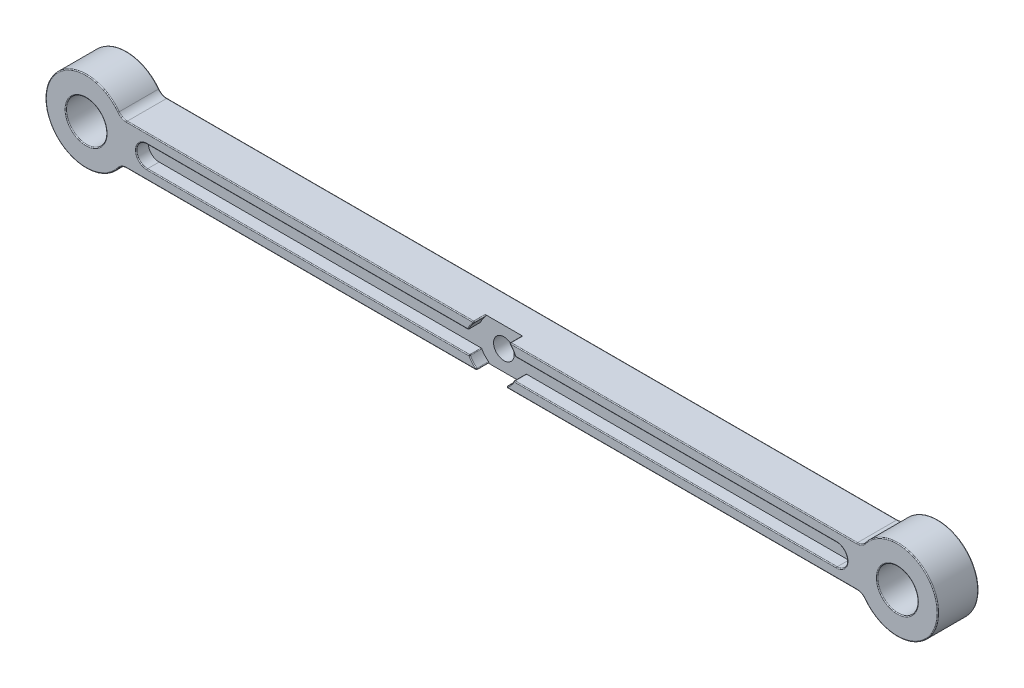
ISO-10303-21;
HEADER;
FILE_DESCRIPTION(('STEP AP214'),'2;1');
FILE_NAME('part.step','',(''),(''),'','','');
FILE_SCHEMA(('AUTOMOTIVE_DESIGN { 1 0 10303 214 1 1 1 1 }'));
ENDSEC;
DATA;
#1=APPLICATION_CONTEXT('core data for automotive mechanical design processes');
#2=APPLICATION_PROTOCOL_DEFINITION('international standard','automotive_design',2000,#1);
#3=PRODUCT_CONTEXT('',#1,'mechanical');
#4=PRODUCT('Part','Part','',(#3));
#5=PRODUCT_RELATED_PRODUCT_CATEGORY('part','',(#4));
#6=PRODUCT_DEFINITION_FORMATION('','',#4);
#7=PRODUCT_DEFINITION_CONTEXT('part definition',#1,'design');
#8=PRODUCT_DEFINITION('design','',#6,#7);
#9=PRODUCT_DEFINITION_SHAPE('','',#8);
#10=(LENGTH_UNIT() NAMED_UNIT(*) SI_UNIT(.MILLI.,.METRE.));
#11=(NAMED_UNIT(*) PLANE_ANGLE_UNIT() SI_UNIT($,.RADIAN.));
#12=(NAMED_UNIT(*) SI_UNIT($,.STERADIAN.) SOLID_ANGLE_UNIT());
#13=UNCERTAINTY_MEASURE_WITH_UNIT(LENGTH_MEASURE(1.E-05),#10,'distance_accuracy_value','');
#14=(GEOMETRIC_REPRESENTATION_CONTEXT(3) GLOBAL_UNCERTAINTY_ASSIGNED_CONTEXT((#13)) GLOBAL_UNIT_ASSIGNED_CONTEXT((#10,
#11,#12)) REPRESENTATION_CONTEXT('',''));
#15=CARTESIAN_POINT('',(0.,0.,0.));
#16=DIRECTION('',(0.,0.,1.));
#17=DIRECTION('',(1.,0.,0.));
#18=AXIS2_PLACEMENT_3D('',#15,#16,#17);
#19=CARTESIAN_POINT('',(-127.,0.,-6.35));
#20=DIRECTION('',(0.,0.,1.));
#21=DIRECTION('',(1.,0.,0.));
#22=AXIS2_PLACEMENT_3D('',#19,#20,#21);
#23=PLANE('',#22);
#24=CARTESIAN_POINT('',(107.95,0.,-6.35));
#25=DIRECTION('',(0.,0.,1.));
#26=DIRECTION('',(1.,0.,0.));
#27=AXIS2_PLACEMENT_3D('',#24,#25,#26);
#28=CIRCLE('',#27,3.6195);
#29=CARTESIAN_POINT('',(107.95,-3.61949999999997,-6.35));
#30=VERTEX_POINT('',#29);
#31=CARTESIAN_POINT('',(107.95,3.61950000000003,-6.35));
#32=VERTEX_POINT('',#31);
#33=EDGE_CURVE('E617',#30,#32,#28,.T.);
#34=ORIENTED_EDGE('',*,*,#33,.T.);
#35=DIRECTION('',(-1.,0.,0.));
#36=VECTOR('',#35,1.);
#37=CARTESIAN_POINT('',(-107.95,3.6195,-6.35));
#38=LINE('',#37,#36);
#39=CARTESIAN_POINT('',(-107.95,3.6195,-6.35));
#40=VERTEX_POINT('',#39);
#41=EDGE_CURVE('E619',#32,#40,#38,.T.);
#42=ORIENTED_EDGE('',*,*,#41,.T.);
#43=CARTESIAN_POINT('',(-107.95,0.,-6.35));
#44=DIRECTION('',(0.,0.,1.));
#45=DIRECTION('',(1.,0.,0.));
#46=AXIS2_PLACEMENT_3D('',#43,#44,#45);
#47=CIRCLE('',#46,3.6195);
#48=CARTESIAN_POINT('',(-107.95,-3.6195,-6.35));
#49=VERTEX_POINT('',#48);
#50=EDGE_CURVE('E613',#40,#49,#47,.T.);
#51=ORIENTED_EDGE('',*,*,#50,.T.);
#52=DIRECTION('',(1.,0.,0.));
#53=VECTOR('',#52,1.);
#54=CARTESIAN_POINT('',(107.95,-3.61949999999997,-6.35));
#55=LINE('',#54,#53);
#56=EDGE_CURVE('E615',#49,#30,#55,.T.);
#57=ORIENTED_EDGE('',*,*,#56,.T.);
#58=EDGE_LOOP('',(#34,#42,#51,#57));
#59=FACE_BOUND('',#58,.T.);
#60=CARTESIAN_POINT('',(-127.,0.,-6.35));
#61=DIRECTION('',(0.,0.,1.));
#62=DIRECTION('',(1.,0.,0.));
#63=AXIS2_PLACEMENT_3D('',#60,#61,#62);
#64=CIRCLE('',#63,6.604);
#65=CARTESIAN_POINT('',(-120.396,0.,-6.35));
#66=VERTEX_POINT('',#65);
#67=EDGE_CURVE('E610',#66,#66,#64,.T.);
#68=ORIENTED_EDGE('',*,*,#67,.T.);
#69=EDGE_LOOP('',(#68));
#70=FACE_BOUND('',#69,.T.);
#71=DIRECTION('',(1.,0.,0.));
#72=VECTOR('',#71,1.);
#73=CARTESIAN_POINT('',(-127.,-6.096,-6.35));
#74=LINE('',#73,#72);
#75=CARTESIAN_POINT('',(114.3,-6.096,-6.35));
#76=VERTEX_POINT('',#75);
#77=CARTESIAN_POINT('',(-114.3,-6.096,-6.35));
#78=VERTEX_POINT('',#77);
#79=EDGE_CURVE('E605',#76,#78,#74,.F.);
#80=ORIENTED_EDGE('',*,*,#79,.T.);
#81=CARTESIAN_POINT('',(-114.3,-9.525,-6.35));
#82=DIRECTION('',(0.,0.,1.));
#83=DIRECTION('',(1.,0.,0.));
#84=AXIS2_PLACEMENT_3D('',#81,#82,#83);
#85=CIRCLE('',#84,3.429);
#86=CARTESIAN_POINT('',(-117.0432,-7.4676,-6.35));
#87=VERTEX_POINT('',#86);
#88=EDGE_CURVE('E607',#78,#87,#85,.T.);
#89=ORIENTED_EDGE('',*,*,#88,.T.);
#90=CARTESIAN_POINT('',(-127.,0.,-6.35));
#91=DIRECTION('',(0.,0.,1.));
#92=DIRECTION('',(1.,0.,0.));
#93=AXIS2_PLACEMENT_3D('',#90,#91,#92);
#94=CIRCLE('',#93,12.446);
#95=CARTESIAN_POINT('',(-117.0432,7.4676,-6.35));
#96=VERTEX_POINT('',#95);
#97=EDGE_CURVE('E593',#87,#96,#94,.F.);
#98=ORIENTED_EDGE('',*,*,#97,.T.);
#99=CARTESIAN_POINT('',(-114.3,9.525,-6.35));
#100=DIRECTION('',(0.,0.,1.));
#101=DIRECTION('',(1.,0.,0.));
#102=AXIS2_PLACEMENT_3D('',#99,#100,#101);
#103=CIRCLE('',#102,3.429);
#104=CARTESIAN_POINT('',(-114.3,6.096,-6.35));
#105=VERTEX_POINT('',#104);
#106=EDGE_CURVE('E595',#96,#105,#103,.T.);
#107=ORIENTED_EDGE('',*,*,#106,.T.);
#108=DIRECTION('',(-1.,0.,0.));
#109=VECTOR('',#108,1.);
#110=CARTESIAN_POINT('',(-127.,6.096,-6.35));
#111=LINE('',#110,#109);
#112=CARTESIAN_POINT('',(114.3,6.096,-6.35));
#113=VERTEX_POINT('',#112);
#114=EDGE_CURVE('E597',#105,#113,#111,.F.);
#115=ORIENTED_EDGE('',*,*,#114,.T.);
#116=CARTESIAN_POINT('',(114.3,9.525,-6.35));
#117=DIRECTION('',(0.,0.,1.));
#118=DIRECTION('',(1.,0.,0.));
#119=AXIS2_PLACEMENT_3D('',#116,#117,#118);
#120=CIRCLE('',#119,3.429);
#121=CARTESIAN_POINT('',(117.0432,7.4676,-6.35));
#122=VERTEX_POINT('',#121);
#123=EDGE_CURVE('E599',#113,#122,#120,.T.);
#124=ORIENTED_EDGE('',*,*,#123,.T.);
#125=CARTESIAN_POINT('',(127.,0.,-6.35));
#126=DIRECTION('',(0.,0.,1.));
#127=DIRECTION('',(1.,0.,0.));
#128=AXIS2_PLACEMENT_3D('',#125,#126,#127);
#129=CIRCLE('',#128,12.446);
#130=CARTESIAN_POINT('',(117.0432,-7.4676,-6.35));
#131=VERTEX_POINT('',#130);
#132=EDGE_CURVE('E601',#122,#131,#129,.F.);
#133=ORIENTED_EDGE('',*,*,#132,.T.);
#134=CARTESIAN_POINT('',(114.3,-9.525,-6.35));
#135=DIRECTION('',(0.,0.,1.));
#136=DIRECTION('',(1.,0.,0.));
#137=AXIS2_PLACEMENT_3D('',#134,#135,#136);
#138=CIRCLE('',#137,3.429);
#139=EDGE_CURVE('E603',#131,#76,#138,.T.);
#140=ORIENTED_EDGE('',*,*,#139,.T.);
#141=EDGE_LOOP('',(#80,#89,#98,#107,#115,#124,#133,#140));
#142=FACE_BOUND('',#141,.T.);
#143=CARTESIAN_POINT('',(127.,0.,-6.35));
#144=DIRECTION('',(0.,0.,1.));
#145=DIRECTION('',(1.,0.,0.));
#146=AXIS2_PLACEMENT_3D('',#143,#144,#145);
#147=CIRCLE('',#146,6.604);
#148=CARTESIAN_POINT('',(133.604,0.,-6.35));
#149=VERTEX_POINT('',#148);
#150=EDGE_CURVE('E590',#149,#149,#147,.T.);
#151=ORIENTED_EDGE('',*,*,#150,.T.);
#152=EDGE_LOOP('',(#151));
#153=FACE_BOUND('',#152,.T.);
#154=ADVANCED_FACE('F32',(#59,#70,#142,#153),#23,.F.);
#155=CARTESIAN_POINT('',(-127.,0.,6.35));
#156=DIRECTION('',(0.,0.,1.));
#157=DIRECTION('',(1.,0.,0.));
#158=AXIS2_PLACEMENT_3D('',#155,#156,#157);
#159=PLANE('',#158);
#160=CARTESIAN_POINT('',(127.,0.,6.35));
#161=DIRECTION('',(0.,0.,1.));
#162=DIRECTION('',(1.,0.,0.));
#163=AXIS2_PLACEMENT_3D('',#160,#161,#162);
#164=CIRCLE('',#163,6.604);
#165=CARTESIAN_POINT('',(133.604,0.,6.35));
#166=VERTEX_POINT('',#165);
#167=EDGE_CURVE('E553',#166,#166,#164,.F.);
#168=ORIENTED_EDGE('',*,*,#167,.T.);
#169=EDGE_LOOP('',(#168));
#170=FACE_BOUND('',#169,.T.);
#171=CARTESIAN_POINT('',(114.3,9.525,6.35));
#172=DIRECTION('',(0.,0.,1.));
#173=DIRECTION('',(1.,0.,0.));
#174=AXIS2_PLACEMENT_3D('',#171,#172,#173);
#175=CIRCLE('',#174,3.429);
#176=CARTESIAN_POINT('',(117.0432,7.4676,6.35));
#177=VERTEX_POINT('',#176);
#178=CARTESIAN_POINT('',(114.3,6.096,6.35));
#179=VERTEX_POINT('',#178);
#180=EDGE_CURVE('E548',#177,#179,#175,.F.);
#181=ORIENTED_EDGE('',*,*,#180,.T.);
#182=DIRECTION('',(-1.,0.,0.));
#183=VECTOR('',#182,1.);
#184=CARTESIAN_POINT('',(5.26187168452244,6.096,6.35));
#185=LINE('',#184,#183);
#186=CARTESIAN_POINT('',(5.89393543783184,6.096,6.35));
#187=VERTEX_POINT('',#186);
#188=EDGE_CURVE('E550',#179,#187,#185,.T.);
#189=ORIENTED_EDGE('',*,*,#188,.T.);
#190=CARTESIAN_POINT('',(0.,0.407221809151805,6.35));
#191=DIRECTION('',(0.,0.,1.));
#192=DIRECTION('',(1.,0.,0.));
#193=AXIS2_PLACEMENT_3D('',#190,#191,#192);
#194=CIRCLE('',#193,8.1915);
#195=CARTESIAN_POINT('',(7.53537929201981,3.61950000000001,6.35));
#196=VERTEX_POINT('',#195);
#197=EDGE_CURVE('E532',#187,#196,#194,.F.);
#198=ORIENTED_EDGE('',*,*,#197,.T.);
#199=DIRECTION('',(-1.,0.,0.));
#200=VECTOR('',#199,1.);
#201=CARTESIAN_POINT('',(107.95,3.61950000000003,6.35));
#202=LINE('',#201,#200);
#203=CARTESIAN_POINT('',(107.95,3.61950000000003,6.35));
#204=VERTEX_POINT('',#203);
#205=EDGE_CURVE('E534',#196,#204,#202,.F.);
#206=ORIENTED_EDGE('',*,*,#205,.T.);
#207=CARTESIAN_POINT('',(107.95,0.,6.35));
#208=DIRECTION('',(0.,0.,1.));
#209=DIRECTION('',(1.,0.,0.));
#210=AXIS2_PLACEMENT_3D('',#207,#208,#209);
#211=CIRCLE('',#210,3.6195);
#212=CARTESIAN_POINT('',(107.95,-3.61949999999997,6.35));
#213=VERTEX_POINT('',#212);
#214=EDGE_CURVE('E536',#204,#213,#211,.F.);
#215=ORIENTED_EDGE('',*,*,#214,.T.);
#216=DIRECTION('',(1.,0.,0.));
#217=VECTOR('',#216,1.);
#218=CARTESIAN_POINT('',(6.98358621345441,-3.61949999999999,6.35));
#219=LINE('',#218,#217);
#220=CARTESIAN_POINT('',(7.13345524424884,-3.61949999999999,6.35));
#221=VERTEX_POINT('',#220);
#222=EDGE_CURVE('E538',#213,#221,#219,.F.);
#223=ORIENTED_EDGE('',*,*,#222,.T.);
#224=CARTESIAN_POINT('',(0.,0.407221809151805,6.35));
#225=DIRECTION('',(0.,0.,1.));
#226=DIRECTION('',(1.,0.,0.));
#227=AXIS2_PLACEMENT_3D('',#224,#225,#226);
#228=CIRCLE('',#227,8.1915);
#229=CARTESIAN_POINT('',(4.98084112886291,-6.096,6.35));
#230=VERTEX_POINT('',#229);
#231=EDGE_CURVE('E540',#221,#230,#228,.F.);
#232=ORIENTED_EDGE('',*,*,#231,.T.);
#233=DIRECTION('',(1.,0.,0.));
#234=VECTOR('',#233,1.);
#235=CARTESIAN_POINT('',(114.3,-6.096,6.35));
#236=LINE('',#235,#234);
#237=CARTESIAN_POINT('',(114.3,-6.096,6.35));
#238=VERTEX_POINT('',#237);
#239=EDGE_CURVE('E542',#230,#238,#236,.T.);
#240=ORIENTED_EDGE('',*,*,#239,.T.);
#241=CARTESIAN_POINT('',(114.3,-9.525,6.35));
#242=DIRECTION('',(0.,0.,1.));
#243=DIRECTION('',(1.,0.,0.));
#244=AXIS2_PLACEMENT_3D('',#241,#242,#243);
#245=CIRCLE('',#244,3.429);
#246=CARTESIAN_POINT('',(117.0432,-7.4676,6.35));
#247=VERTEX_POINT('',#246);
#248=EDGE_CURVE('E544',#238,#247,#245,.F.);
#249=ORIENTED_EDGE('',*,*,#248,.T.);
#250=CARTESIAN_POINT('',(127.,0.,6.35));
#251=DIRECTION('',(0.,0.,1.));
#252=DIRECTION('',(1.,0.,0.));
#253=AXIS2_PLACEMENT_3D('',#250,#251,#252);
#254=CIRCLE('',#253,12.446);
#255=EDGE_CURVE('E546',#247,#177,#254,.T.);
#256=ORIENTED_EDGE('',*,*,#255,.T.);
#257=EDGE_LOOP('',(#181,#189,#198,#206,#215,#223,#232,#240,#249,#256));
#258=FACE_BOUND('',#257,.T.);
#259=ADVANCED_FACE('F814',(#170,#258),#159,.T.);
#260=CARTESIAN_POINT('',(107.95,3.36550000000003,2.54));
#261=DIRECTION('',(0.,1.,0.));
#262=DIRECTION('',(-1.,0.,0.));
#263=AXIS2_PLACEMENT_3D('',#260,#261,#262);
#264=PLANE('',#263);
#265=DIRECTION('',(0.,0.,1.));
#266=VECTOR('',#265,1.);
#267=CARTESIAN_POINT('',(-7.53537929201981,3.36550000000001,2.54));
#268=LINE('',#267,#266);
#269=CARTESIAN_POINT('',(-7.53537929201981,3.36550000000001,2.54));
#270=VERTEX_POINT('',#269);
#271=CARTESIAN_POINT('',(-7.53537929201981,3.36550000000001,6.096));
#272=VERTEX_POINT('',#271);
#273=EDGE_CURVE('E467',#270,#272,#268,.T.);
#274=ORIENTED_EDGE('',*,*,#273,.T.);
#275=DIRECTION('',(-1.,0.,0.));
#276=VECTOR('',#275,1.);
#277=CARTESIAN_POINT('',(-107.95,3.3655,6.096));
#278=LINE('',#277,#276);
#279=CARTESIAN_POINT('',(-107.95,3.3655,6.096));
#280=VERTEX_POINT('',#279);
#281=EDGE_CURVE('E469',#272,#280,#278,.T.);
#282=ORIENTED_EDGE('',*,*,#281,.T.);
#283=DIRECTION('',(0.,0.,1.));
#284=VECTOR('',#283,1.);
#285=CARTESIAN_POINT('',(-107.95,3.3655,2.54));
#286=LINE('',#285,#284);
#287=CARTESIAN_POINT('',(-107.95,3.3655,2.54));
#288=VERTEX_POINT('',#287);
#289=EDGE_CURVE('E402',#288,#280,#286,.T.);
#290=ORIENTED_EDGE('',*,*,#289,.F.);
#291=DIRECTION('',(-1.,0.,0.));
#292=VECTOR('',#291,1.);
#293=CARTESIAN_POINT('',(107.95,3.36550000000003,2.54));
#294=LINE('',#293,#292);
#295=EDGE_CURVE('E397',#270,#288,#294,.T.);
#296=ORIENTED_EDGE('',*,*,#295,.F.);
#297=EDGE_LOOP('',(#274,#282,#290,#296));
#298=FACE_BOUND('',#297,.T.);
#299=ADVANCED_FACE('F933',(#298),#264,.F.);
#300=CARTESIAN_POINT('',(-107.95,-3.3655,2.54));
#301=DIRECTION('',(0.,-1.,0.));
#302=DIRECTION('',(1.,0.,0.));
#303=AXIS2_PLACEMENT_3D('',#300,#301,#302);
#304=PLANE('',#303);
#305=DIRECTION('',(0.,0.,1.));
#306=VECTOR('',#305,1.);
#307=CARTESIAN_POINT('',(7.13345524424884,-3.36549999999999,2.54));
#308=LINE('',#307,#306);
#309=CARTESIAN_POINT('',(7.13345524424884,-3.36549999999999,2.54));
#310=VERTEX_POINT('',#309);
#311=CARTESIAN_POINT('',(7.13345524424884,-3.36549999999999,6.096));
#312=VERTEX_POINT('',#311);
#313=EDGE_CURVE('E574',#310,#312,#308,.T.);
#314=ORIENTED_EDGE('',*,*,#313,.T.);
#315=DIRECTION('',(1.,0.,0.));
#316=VECTOR('',#315,1.);
#317=CARTESIAN_POINT('',(107.95,-3.36549999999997,6.096));
#318=LINE('',#317,#316);
#319=CARTESIAN_POINT('',(107.95,-3.36549999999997,6.096));
#320=VERTEX_POINT('',#319);
#321=EDGE_CURVE('E576',#312,#320,#318,.T.);
#322=ORIENTED_EDGE('',*,*,#321,.T.);
#323=DIRECTION('',(0.,0.,1.));
#324=VECTOR('',#323,1.);
#325=CARTESIAN_POINT('',(107.95,-3.36549999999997,2.54));
#326=LINE('',#325,#324);
#327=CARTESIAN_POINT('',(107.95,-3.36549999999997,2.54));
#328=VERTEX_POINT('',#327);
#329=EDGE_CURVE('E409',#328,#320,#326,.T.);
#330=ORIENTED_EDGE('',*,*,#329,.F.);
#331=DIRECTION('',(1.,0.,0.));
#332=VECTOR('',#331,1.);
#333=CARTESIAN_POINT('',(-107.95,-3.3655,2.54));
#334=LINE('',#333,#332);
#335=EDGE_CURVE('E390',#310,#328,#334,.T.);
#336=ORIENTED_EDGE('',*,*,#335,.F.);
#337=EDGE_LOOP('',(#314,#322,#330,#336));
#338=FACE_BOUND('',#337,.T.);
#339=ADVANCED_FACE('F1555',(#338),#304,.F.);
#340=CARTESIAN_POINT('',(-127.,0.,6.35));
#341=DIRECTION('',(0.,0.,1.));
#342=DIRECTION('',(1.,0.,0.));
#343=AXIS2_PLACEMENT_3D('',#340,#341,#342);
#344=CIRCLE('',#343,6.604);
#345=CARTESIAN_POINT('',(-120.396,0.,6.35));
#346=VERTEX_POINT('',#345);
#347=EDGE_CURVE('E464',#346,#346,#344,.F.);
#348=ORIENTED_EDGE('',*,*,#347,.T.);
#349=EDGE_LOOP('',(#348));
#350=FACE_BOUND('',#349,.T.);
#351=CARTESIAN_POINT('',(-107.95,0.,6.35));
#352=DIRECTION('',(0.,0.,1.));
#353=DIRECTION('',(1.,0.,0.));
#354=AXIS2_PLACEMENT_3D('',#351,#352,#353);
#355=CIRCLE('',#354,3.6195);
#356=CARTESIAN_POINT('',(-107.95,-3.6195,6.35));
#357=VERTEX_POINT('',#356);
#358=CARTESIAN_POINT('',(-107.95,3.6195,6.35));
#359=VERTEX_POINT('',#358);
#360=EDGE_CURVE('E459',#357,#359,#355,.F.);
#361=ORIENTED_EDGE('',*,*,#360,.T.);
#362=DIRECTION('',(-1.,0.,0.));
#363=VECTOR('',#362,1.);
#364=CARTESIAN_POINT('',(-7.36562939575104,3.61950000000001,6.35));
#365=LINE('',#364,#363);
#366=CARTESIAN_POINT('',(-7.53537929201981,3.61950000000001,6.35));
#367=VERTEX_POINT('',#366);
#368=EDGE_CURVE('E461',#359,#367,#365,.F.);
#369=ORIENTED_EDGE('',*,*,#368,.T.);
#370=CARTESIAN_POINT('',(0.,0.407221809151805,6.35));
#371=DIRECTION('',(0.,0.,1.));
#372=DIRECTION('',(1.,0.,0.));
#373=AXIS2_PLACEMENT_3D('',#370,#371,#372);
#374=CIRCLE('',#373,8.1915);
#375=CARTESIAN_POINT('',(-5.89393543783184,6.096,6.35));
#376=VERTEX_POINT('',#375);
#377=EDGE_CURVE('E443',#367,#376,#374,.F.);
#378=ORIENTED_EDGE('',*,*,#377,.T.);
#379=DIRECTION('',(-1.,0.,0.));
#380=VECTOR('',#379,1.);
#381=CARTESIAN_POINT('',(-114.3,6.096,6.35));
#382=LINE('',#381,#380);
#383=CARTESIAN_POINT('',(-114.3,6.096,6.35));
#384=VERTEX_POINT('',#383);
#385=EDGE_CURVE('E445',#376,#384,#382,.T.);
#386=ORIENTED_EDGE('',*,*,#385,.T.);
#387=CARTESIAN_POINT('',(-114.3,9.525,6.35));
#388=DIRECTION('',(0.,0.,1.));
#389=DIRECTION('',(1.,0.,0.));
#390=AXIS2_PLACEMENT_3D('',#387,#388,#389);
#391=CIRCLE('',#390,3.429);
#392=CARTESIAN_POINT('',(-117.0432,7.4676,6.35));
#393=VERTEX_POINT('',#392);
#394=EDGE_CURVE('E447',#384,#393,#391,.F.);
#395=ORIENTED_EDGE('',*,*,#394,.T.);
#396=CARTESIAN_POINT('',(-127.,0.,6.35));
#397=DIRECTION('',(0.,0.,1.));
#398=DIRECTION('',(1.,0.,0.));
#399=AXIS2_PLACEMENT_3D('',#396,#397,#398);
#400=CIRCLE('',#399,12.446);
#401=CARTESIAN_POINT('',(-117.0432,-7.4676,6.35));
#402=VERTEX_POINT('',#401);
#403=EDGE_CURVE('E449',#393,#402,#400,.T.);
#404=ORIENTED_EDGE('',*,*,#403,.T.);
#405=CARTESIAN_POINT('',(-114.3,-9.525,6.35));
#406=DIRECTION('',(0.,0.,1.));
#407=DIRECTION('',(1.,0.,0.));
#408=AXIS2_PLACEMENT_3D('',#405,#406,#407);
#409=CIRCLE('',#408,3.429);
#410=CARTESIAN_POINT('',(-114.3,-6.096,6.35));
#411=VERTEX_POINT('',#410);
#412=EDGE_CURVE('E451',#402,#411,#409,.F.);
#413=ORIENTED_EDGE('',*,*,#412,.T.);
#414=DIRECTION('',(1.,0.,0.));
#415=VECTOR('',#414,1.);
#416=CARTESIAN_POINT('',(-4.16459597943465,-6.096,6.35));
#417=LINE('',#416,#415);
#418=CARTESIAN_POINT('',(-4.98084112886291,-6.096,6.35));
#419=VERTEX_POINT('',#418);
#420=EDGE_CURVE('E453',#411,#419,#417,.T.);
#421=ORIENTED_EDGE('',*,*,#420,.T.);
#422=CARTESIAN_POINT('',(0.,0.407221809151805,6.35));
#423=DIRECTION('',(0.,0.,1.));
#424=DIRECTION('',(1.,0.,0.));
#425=AXIS2_PLACEMENT_3D('',#422,#423,#424);
#426=CIRCLE('',#425,8.1915);
#427=CARTESIAN_POINT('',(-7.13345524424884,-3.61949999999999,6.35));
#428=VERTEX_POINT('',#427);
#429=EDGE_CURVE('E455',#419,#428,#426,.F.);
#430=ORIENTED_EDGE('',*,*,#429,.T.);
#431=DIRECTION('',(1.,0.,0.));
#432=VECTOR('',#431,1.);
#433=CARTESIAN_POINT('',(-107.95,-3.6195,6.35));
#434=LINE('',#433,#432);
#435=EDGE_CURVE('E457',#428,#357,#434,.F.);
#436=ORIENTED_EDGE('',*,*,#435,.T.);
#437=EDGE_LOOP('',(#361,#369,#378,#386,#395,#404,#413,#421,#430,#436));
#438=FACE_BOUND('',#437,.T.);
#439=ADVANCED_FACE('F936',(#350,#438),#159,.T.);
#440=CARTESIAN_POINT('',(-127.,0.,6.35));
#441=DIRECTION('',(0.,0.,-1.));
#442=DIRECTION('',(-1.,0.,0.));
#443=AXIS2_PLACEMENT_3D('',#440,#441,#442);
#444=CYLINDRICAL_SURFACE('',#443,12.7);
#445=DIRECTION('',(0.,0.,-1.));
#446=VECTOR('',#445,1.);
#447=CARTESIAN_POINT('',(-116.84,-7.62,6.35));
#448=LINE('',#447,#446);
#449=CARTESIAN_POINT('',(-116.84,-7.62,-6.096));
#450=VERTEX_POINT('',#449);
#451=CARTESIAN_POINT('',(-116.84,-7.62,6.096));
#452=VERTEX_POINT('',#451);
#453=EDGE_CURVE('E434',#450,#452,#448,.F.);
#454=ORIENTED_EDGE('',*,*,#453,.T.);
#455=CARTESIAN_POINT('',(-127.,0.,6.096));
#456=DIRECTION('',(0.,0.,1.));
#457=DIRECTION('',(1.,0.,0.));
#458=AXIS2_PLACEMENT_3D('',#455,#456,#457);
#459=CIRCLE('',#458,12.7);
#460=CARTESIAN_POINT('',(-116.84,7.62,6.096));
#461=VERTEX_POINT('',#460);
#462=EDGE_CURVE('E502',#452,#461,#459,.F.);
#463=ORIENTED_EDGE('',*,*,#462,.T.);
#464=DIRECTION('',(0.,0.,-1.));
#465=VECTOR('',#464,1.);
#466=CARTESIAN_POINT('',(-116.84,7.62,6.35));
#467=LINE('',#466,#465);
#468=CARTESIAN_POINT('',(-116.84,7.62,-6.096));
#469=VERTEX_POINT('',#468);
#470=EDGE_CURVE('E431',#461,#469,#467,.T.);
#471=ORIENTED_EDGE('',*,*,#470,.T.);
#472=CARTESIAN_POINT('',(-127.,0.,-6.096));
#473=DIRECTION('',(0.,0.,1.));
#474=DIRECTION('',(1.,0.,0.));
#475=AXIS2_PLACEMENT_3D('',#472,#473,#474);
#476=CIRCLE('',#475,12.7);
#477=EDGE_CURVE('E500',#469,#450,#476,.T.);
#478=ORIENTED_EDGE('',*,*,#477,.T.);
#479=EDGE_LOOP('',(#454,#463,#471,#478));
#480=FACE_BOUND('',#479,.T.);
#481=ADVANCED_FACE('F891',(#480),#444,.T.);
#482=CARTESIAN_POINT('',(-116.001477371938,-6.35,6.35));
#483=DIRECTION('',(0.,1.,0.));
#484=DIRECTION('',(0.,0.,1.));
#485=AXIS2_PLACEMENT_3D('',#482,#483,#484);
#486=PLANE('',#485);
#487=DIRECTION('',(0.,0.,1.));
#488=VECTOR('',#487,1.);
#489=CARTESIAN_POINT('',(-114.3,-6.35,-6.35));
#490=LINE('',#489,#488);
#491=CARTESIAN_POINT('',(-114.3,-6.35,6.096));
#492=VERTEX_POINT('',#491);
#493=CARTESIAN_POINT('',(-114.3,-6.35,-6.096));
#494=VERTEX_POINT('',#493);
#495=EDGE_CURVE('E425',#492,#494,#490,.F.);
#496=ORIENTED_EDGE('',*,*,#495,.T.);
#497=DIRECTION('',(1.,0.,0.));
#498=VECTOR('',#497,1.);
#499=CARTESIAN_POINT('',(-116.001477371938,-6.35,-6.096));
#500=LINE('',#499,#498);
#501=CARTESIAN_POINT('',(114.3,-6.35,-6.096));
#502=VERTEX_POINT('',#501);
#503=EDGE_CURVE('E493',#494,#502,#500,.T.);
#504=ORIENTED_EDGE('',*,*,#503,.T.);
#505=DIRECTION('',(0.,0.,1.));
#506=VECTOR('',#505,1.);
#507=CARTESIAN_POINT('',(114.3,-6.35,6.35));
#508=LINE('',#507,#506);
#509=CARTESIAN_POINT('',(114.3,-6.35,6.096));
#510=VERTEX_POINT('',#509);
#511=EDGE_CURVE('E428',#502,#510,#508,.T.);
#512=ORIENTED_EDGE('',*,*,#511,.T.);
#513=DIRECTION('',(1.,0.,0.));
#514=VECTOR('',#513,1.);
#515=CARTESIAN_POINT('',(4.16459597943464,-6.35,6.096));
#516=LINE('',#515,#514);
#517=CARTESIAN_POINT('',(4.98084112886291,-6.35,6.096));
#518=VERTEX_POINT('',#517);
#519=EDGE_CURVE('E491',#510,#518,#516,.F.);
#520=ORIENTED_EDGE('',*,*,#519,.T.);
#521=DIRECTION('',(0.,0.,1.));
#522=VECTOR('',#521,1.);
#523=CARTESIAN_POINT('',(4.98084112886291,-6.35,6.35));
#524=LINE('',#523,#522);
#525=CARTESIAN_POINT('',(4.98084112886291,-6.35,2.54));
#526=VERTEX_POINT('',#525);
#527=EDGE_CURVE('E488',#518,#526,#524,.F.);
#528=ORIENTED_EDGE('',*,*,#527,.T.);
#529=DIRECTION('',(1.,0.,0.));
#530=VECTOR('',#529,1.);
#531=CARTESIAN_POINT('',(-116.001477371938,-6.35,2.54));
#532=LINE('',#531,#530);
#533=CARTESIAN_POINT('',(-4.98084112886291,-6.35,2.54));
#534=VERTEX_POINT('',#533);
#535=EDGE_CURVE('E385',#534,#526,#532,.T.);
#536=ORIENTED_EDGE('',*,*,#535,.F.);
#537=DIRECTION('',(0.,0.,1.));
#538=VECTOR('',#537,1.);
#539=CARTESIAN_POINT('',(-4.98084112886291,-6.35,6.35));
#540=LINE('',#539,#538);
#541=CARTESIAN_POINT('',(-4.98084112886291,-6.35,6.096));
#542=VERTEX_POINT('',#541);
#543=EDGE_CURVE('E484',#534,#542,#540,.T.);
#544=ORIENTED_EDGE('',*,*,#543,.T.);
#545=DIRECTION('',(1.,0.,0.));
#546=VECTOR('',#545,1.);
#547=CARTESIAN_POINT('',(-114.3,-6.35,6.096));
#548=LINE('',#547,#546);
#549=EDGE_CURVE('E486',#542,#492,#548,.F.);
#550=ORIENTED_EDGE('',*,*,#549,.T.);
#551=EDGE_LOOP('',(#496,#504,#512,#520,#528,#536,#544,#550));
#552=FACE_BOUND('',#551,.T.);
#553=ADVANCED_FACE('F838',(#552),#486,.F.);
#554=CARTESIAN_POINT('',(127.,0.,6.35));
#555=DIRECTION('',(0.,0.,-1.));
#556=DIRECTION('',(-1.,0.,0.));
#557=AXIS2_PLACEMENT_3D('',#554,#555,#556);
#558=CYLINDRICAL_SURFACE('',#557,12.7);
#559=DIRECTION('',(0.,0.,-1.));
#560=VECTOR('',#559,1.);
#561=CARTESIAN_POINT('',(116.84,7.62,6.35));
#562=LINE('',#561,#560);
#563=CARTESIAN_POINT('',(116.84,7.62,-6.096));
#564=VERTEX_POINT('',#563);
#565=CARTESIAN_POINT('',(116.84,7.62,6.096));
#566=VERTEX_POINT('',#565);
#567=EDGE_CURVE('E422',#564,#566,#562,.F.);
#568=ORIENTED_EDGE('',*,*,#567,.T.);
#569=CARTESIAN_POINT('',(127.,0.,6.096));
#570=DIRECTION('',(0.,0.,1.));
#571=DIRECTION('',(1.,0.,0.));
#572=AXIS2_PLACEMENT_3D('',#569,#570,#571);
#573=CIRCLE('',#572,12.7);
#574=CARTESIAN_POINT('',(116.84,-7.62,6.096));
#575=VERTEX_POINT('',#574);
#576=EDGE_CURVE('E562',#566,#575,#573,.F.);
#577=ORIENTED_EDGE('',*,*,#576,.T.);
#578=DIRECTION('',(0.,0.,-1.));
#579=VECTOR('',#578,1.);
#580=CARTESIAN_POINT('',(116.84,-7.62,6.35));
#581=LINE('',#580,#579);
#582=CARTESIAN_POINT('',(116.84,-7.62,-6.096));
#583=VERTEX_POINT('',#582);
#584=EDGE_CURVE('E419',#575,#583,#581,.T.);
#585=ORIENTED_EDGE('',*,*,#584,.T.);
#586=CARTESIAN_POINT('',(127.,0.,-6.096));
#587=DIRECTION('',(0.,0.,1.));
#588=DIRECTION('',(1.,0.,0.));
#589=AXIS2_PLACEMENT_3D('',#586,#587,#588);
#590=CIRCLE('',#589,12.7);
#591=EDGE_CURVE('E560',#583,#564,#590,.T.);
#592=ORIENTED_EDGE('',*,*,#591,.T.);
#593=EDGE_LOOP('',(#568,#577,#585,#592));
#594=FACE_BOUND('',#593,.T.);
#595=ADVANCED_FACE('F822',(#594),#558,.T.);
#596=CARTESIAN_POINT('',(-116.001477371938,6.35,6.35));
#597=DIRECTION('',(0.,-1.,0.));
#598=DIRECTION('',(0.,0.,-1.));
#599=AXIS2_PLACEMENT_3D('',#596,#597,#598);
#600=PLANE('',#599);
#601=DIRECTION('',(0.,0.,1.));
#602=VECTOR('',#601,1.);
#603=CARTESIAN_POINT('',(114.3,6.35,-6.35));
#604=LINE('',#603,#602);
#605=CARTESIAN_POINT('',(114.3,6.35,6.096));
#606=VERTEX_POINT('',#605);
#607=CARTESIAN_POINT('',(114.3,6.35,-6.096));
#608=VERTEX_POINT('',#607);
#609=EDGE_CURVE('E416',#606,#608,#604,.F.);
#610=ORIENTED_EDGE('',*,*,#609,.T.);
#611=DIRECTION('',(-1.,0.,0.));
#612=VECTOR('',#611,1.);
#613=CARTESIAN_POINT('',(-116.001477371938,6.35,-6.096));
#614=LINE('',#613,#612);
#615=CARTESIAN_POINT('',(-114.3,6.35,-6.096));
#616=VERTEX_POINT('',#615);
#617=EDGE_CURVE('E518',#608,#616,#614,.T.);
#618=ORIENTED_EDGE('',*,*,#617,.T.);
#619=DIRECTION('',(0.,0.,1.));
#620=VECTOR('',#619,1.);
#621=CARTESIAN_POINT('',(-114.3,6.35,6.35));
#622=LINE('',#621,#620);
#623=CARTESIAN_POINT('',(-114.3,6.35,6.096));
#624=VERTEX_POINT('',#623);
#625=EDGE_CURVE('E405',#616,#624,#622,.T.);
#626=ORIENTED_EDGE('',*,*,#625,.T.);
#627=DIRECTION('',(-1.,0.,0.));
#628=VECTOR('',#627,1.);
#629=CARTESIAN_POINT('',(-5.26187168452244,6.35,6.096));
#630=LINE('',#629,#628);
#631=CARTESIAN_POINT('',(-5.89393543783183,6.35,6.096));
#632=VERTEX_POINT('',#631);
#633=EDGE_CURVE('E516',#624,#632,#630,.F.);
#634=ORIENTED_EDGE('',*,*,#633,.T.);
#635=DIRECTION('',(0.,0.,1.));
#636=VECTOR('',#635,1.);
#637=CARTESIAN_POINT('',(-5.89393543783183,6.35,6.35));
#638=LINE('',#637,#636);
#639=CARTESIAN_POINT('',(-5.89393543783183,6.35,2.54));
#640=VERTEX_POINT('',#639);
#641=EDGE_CURVE('E513',#632,#640,#638,.F.);
#642=ORIENTED_EDGE('',*,*,#641,.T.);
#643=DIRECTION('',(-1.,0.,0.));
#644=VECTOR('',#643,1.);
#645=CARTESIAN_POINT('',(-116.001477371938,6.35,2.54));
#646=LINE('',#645,#644);
#647=CARTESIAN_POINT('',(5.89393543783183,6.35,2.54));
#648=VERTEX_POINT('',#647);
#649=EDGE_CURVE('E383',#648,#640,#646,.T.);
#650=ORIENTED_EDGE('',*,*,#649,.F.);
#651=DIRECTION('',(0.,0.,1.));
#652=VECTOR('',#651,1.);
#653=CARTESIAN_POINT('',(5.89393543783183,6.35,6.35));
#654=LINE('',#653,#652);
#655=CARTESIAN_POINT('',(5.89393543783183,6.35,6.096));
#656=VERTEX_POINT('',#655);
#657=EDGE_CURVE('E508',#648,#656,#654,.T.);
#658=ORIENTED_EDGE('',*,*,#657,.T.);
#659=DIRECTION('',(-1.,0.,0.));
#660=VECTOR('',#659,1.);
#661=CARTESIAN_POINT('',(114.3,6.35,6.096));
#662=LINE('',#661,#660);
#663=EDGE_CURVE('E510',#656,#606,#662,.F.);
#664=ORIENTED_EDGE('',*,*,#663,.T.);
#665=EDGE_LOOP('',(#610,#618,#626,#634,#642,#650,#658,#664));
#666=FACE_BOUND('',#665,.T.);
#667=ADVANCED_FACE('F793',(#666),#600,.F.);
#668=CARTESIAN_POINT('',(-127.,0.,6.35));
#669=DIRECTION('',(0.,0.,-1.));
#670=DIRECTION('',(-1.,0.,0.));
#671=AXIS2_PLACEMENT_3D('',#668,#669,#670);
#672=CYLINDRICAL_SURFACE('',#671,6.35);
#673=CARTESIAN_POINT('',(-127.,0.,6.096));
#674=DIRECTION('',(0.,0.,1.));
#675=DIRECTION('',(1.,0.,0.));
#676=AXIS2_PLACEMENT_3D('',#673,#674,#675);
#677=CIRCLE('',#676,6.35);
#678=CARTESIAN_POINT('',(-120.65,0.,6.096));
#679=VERTEX_POINT('',#678);
#680=EDGE_CURVE('E440',#679,#679,#677,.T.);
#681=ORIENTED_EDGE('',*,*,#680,.T.);
#682=EDGE_LOOP('',(#681));
#683=FACE_BOUND('',#682,.T.);
#684=CARTESIAN_POINT('',(-127.,0.,-6.096));
#685=DIRECTION('',(0.,0.,1.));
#686=DIRECTION('',(1.,0.,0.));
#687=AXIS2_PLACEMENT_3D('',#684,#685,#686);
#688=CIRCLE('',#687,6.35);
#689=CARTESIAN_POINT('',(-120.65,0.,-6.096));
#690=VERTEX_POINT('',#689);
#691=EDGE_CURVE('E436',#690,#690,#688,.F.);
#692=ORIENTED_EDGE('',*,*,#691,.T.);
#693=EDGE_LOOP('',(#692));
#694=FACE_BOUND('',#693,.T.);
#695=ADVANCED_FACE('F942',(#683,#694),#672,.F.);
#696=CARTESIAN_POINT('',(127.,0.,6.35));
#697=DIRECTION('',(0.,0.,-1.));
#698=DIRECTION('',(-1.,0.,0.));
#699=AXIS2_PLACEMENT_3D('',#696,#697,#698);
#700=CYLINDRICAL_SURFACE('',#699,6.35);
#701=CARTESIAN_POINT('',(127.,0.,6.096));
#702=DIRECTION('',(0.,0.,1.));
#703=DIRECTION('',(1.,0.,0.));
#704=AXIS2_PLACEMENT_3D('',#701,#702,#703);
#705=CIRCLE('',#704,6.35);
#706=CARTESIAN_POINT('',(133.35,0.,6.096));
#707=VERTEX_POINT('',#706);
#708=EDGE_CURVE('E529',#707,#707,#705,.T.);
#709=ORIENTED_EDGE('',*,*,#708,.T.);
#710=EDGE_LOOP('',(#709));
#711=FACE_BOUND('',#710,.T.);
#712=CARTESIAN_POINT('',(127.,0.,-6.096));
#713=DIRECTION('',(0.,0.,1.));
#714=DIRECTION('',(1.,0.,0.));
#715=AXIS2_PLACEMENT_3D('',#712,#713,#714);
#716=CIRCLE('',#715,6.35);
#717=CARTESIAN_POINT('',(133.35,0.,-6.096));
#718=VERTEX_POINT('',#717);
#719=EDGE_CURVE('E526',#718,#718,#716,.F.);
#720=ORIENTED_EDGE('',*,*,#719,.T.);
#721=EDGE_LOOP('',(#720));
#722=FACE_BOUND('',#721,.T.);
#723=ADVANCED_FACE('F1584',(#711,#722),#700,.F.);
#724=CARTESIAN_POINT('',(-107.95,0.,2.54));
#725=DIRECTION('',(0.,0.,1.));
#726=DIRECTION('',(1.,0.,0.));
#727=AXIS2_PLACEMENT_3D('',#724,#725,#726);
#728=CYLINDRICAL_SURFACE('',#727,3.3655);
#729=ORIENTED_EDGE('',*,*,#289,.T.);
#730=CARTESIAN_POINT('',(-107.95,0.,6.096));
#731=DIRECTION('',(0.,0.,1.));
#732=DIRECTION('',(1.,0.,0.));
#733=AXIS2_PLACEMENT_3D('',#730,#731,#732);
#734=CIRCLE('',#733,3.3655);
#735=CARTESIAN_POINT('',(-107.95,-3.3655,6.096));
#736=VERTEX_POINT('',#735);
#737=EDGE_CURVE('E472',#280,#736,#734,.T.);
#738=ORIENTED_EDGE('',*,*,#737,.T.);
#739=DIRECTION('',(0.,0.,1.));
#740=VECTOR('',#739,1.);
#741=CARTESIAN_POINT('',(-107.95,-3.3655,2.54));
#742=LINE('',#741,#740);
#743=CARTESIAN_POINT('',(-107.95,-3.3655,2.54));
#744=VERTEX_POINT('',#743);
#745=EDGE_CURVE('E401',#744,#736,#742,.T.);
#746=ORIENTED_EDGE('',*,*,#745,.F.);
#747=CARTESIAN_POINT('',(-107.95,0.,2.54));
#748=DIRECTION('',(0.,0.,1.));
#749=DIRECTION('',(1.,0.,0.));
#750=AXIS2_PLACEMENT_3D('',#747,#748,#749);
#751=CIRCLE('',#750,3.3655);
#752=EDGE_CURVE('E387',#288,#744,#751,.T.);
#753=ORIENTED_EDGE('',*,*,#752,.F.);
#754=EDGE_LOOP('',(#729,#738,#746,#753));
#755=FACE_BOUND('',#754,.T.);
#756=ADVANCED_FACE('F1574',(#755),#728,.F.);
#757=DIRECTION('',(0.,0.,1.));
#758=VECTOR('',#757,1.);
#759=CARTESIAN_POINT('',(107.95,3.36550000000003,2.54));
#760=LINE('',#759,#758);
#761=CARTESIAN_POINT('',(107.95,3.36550000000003,2.54));
#762=VERTEX_POINT('',#761);
#763=CARTESIAN_POINT('',(107.95,3.36550000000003,6.096));
#764=VERTEX_POINT('',#763);
#765=EDGE_CURVE('E406',#762,#764,#760,.T.);
#766=ORIENTED_EDGE('',*,*,#765,.T.);
#767=DIRECTION('',(-1.,0.,0.));
#768=VECTOR('',#767,1.);
#769=CARTESIAN_POINT('',(7.36562939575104,3.36550000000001,6.096));
#770=LINE('',#769,#768);
#771=CARTESIAN_POINT('',(7.53537929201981,3.36550000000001,6.096));
#772=VERTEX_POINT('',#771);
#773=EDGE_CURVE('E582',#764,#772,#770,.T.);
#774=ORIENTED_EDGE('',*,*,#773,.T.);
#775=DIRECTION('',(0.,0.,1.));
#776=VECTOR('',#775,1.);
#777=CARTESIAN_POINT('',(7.53537929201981,3.36550000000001,2.54));
#778=LINE('',#777,#776);
#779=CARTESIAN_POINT('',(7.53537929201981,3.36550000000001,2.54));
#780=VERTEX_POINT('',#779);
#781=EDGE_CURVE('E580',#772,#780,#778,.F.);
#782=ORIENTED_EDGE('',*,*,#781,.T.);
#783=EDGE_CURVE('E398',#762,#780,#294,.T.);
#784=ORIENTED_EDGE('',*,*,#783,.F.);
#785=EDGE_LOOP('',(#766,#774,#782,#784));
#786=FACE_BOUND('',#785,.T.);
#787=ADVANCED_FACE('F1564',(#786),#264,.F.);
#788=CARTESIAN_POINT('',(107.95,0.,2.54));
#789=DIRECTION('',(0.,0.,1.));
#790=DIRECTION('',(1.,0.,0.));
#791=AXIS2_PLACEMENT_3D('',#788,#789,#790);
#792=CYLINDRICAL_SURFACE('',#791,3.3655);
#793=ORIENTED_EDGE('',*,*,#329,.T.);
#794=CARTESIAN_POINT('',(107.95,0.,6.096));
#795=DIRECTION('',(0.,0.,1.));
#796=DIRECTION('',(1.,0.,0.));
#797=AXIS2_PLACEMENT_3D('',#794,#795,#796);
#798=CIRCLE('',#797,3.3655);
#799=EDGE_CURVE('E578',#320,#764,#798,.T.);
#800=ORIENTED_EDGE('',*,*,#799,.T.);
#801=ORIENTED_EDGE('',*,*,#765,.F.);
#802=CARTESIAN_POINT('',(107.95,0.,2.54));
#803=DIRECTION('',(0.,0.,1.));
#804=DIRECTION('',(-1.,0.,0.));
#805=AXIS2_PLACEMENT_3D('',#802,#803,#804);
#806=CIRCLE('',#805,3.3655);
#807=EDGE_CURVE('E394',#328,#762,#806,.T.);
#808=ORIENTED_EDGE('',*,*,#807,.F.);
#809=EDGE_LOOP('',(#793,#800,#801,#808));
#810=FACE_BOUND('',#809,.T.);
#811=ADVANCED_FACE('F1552',(#810),#792,.F.);
#812=ORIENTED_EDGE('',*,*,#745,.T.);
#813=DIRECTION('',(1.,0.,0.));
#814=VECTOR('',#813,1.);
#815=CARTESIAN_POINT('',(-6.98358621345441,-3.36549999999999,6.096));
#816=LINE('',#815,#814);
#817=CARTESIAN_POINT('',(-7.13345524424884,-3.36549999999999,6.096));
#818=VERTEX_POINT('',#817);
#819=EDGE_CURVE('E476',#736,#818,#816,.T.);
#820=ORIENTED_EDGE('',*,*,#819,.T.);
#821=DIRECTION('',(0.,0.,1.));
#822=VECTOR('',#821,1.);
#823=CARTESIAN_POINT('',(-7.13345524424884,-3.36549999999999,2.54));
#824=LINE('',#823,#822);
#825=CARTESIAN_POINT('',(-7.13345524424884,-3.36549999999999,2.54));
#826=VERTEX_POINT('',#825);
#827=EDGE_CURVE('E474',#818,#826,#824,.F.);
#828=ORIENTED_EDGE('',*,*,#827,.T.);
#829=EDGE_CURVE('E391',#744,#826,#334,.T.);
#830=ORIENTED_EDGE('',*,*,#829,.F.);
#831=EDGE_LOOP('',(#812,#820,#828,#830));
#832=FACE_BOUND('',#831,.T.);
#833=ADVANCED_FACE('F1540',(#832),#304,.F.);
#834=CARTESIAN_POINT('',(-107.95,0.,2.54));
#835=DIRECTION('',(0.,0.,1.));
#836=DIRECTION('',(1.,0.,0.));
#837=AXIS2_PLACEMENT_3D('',#834,#835,#836);
#838=PLANE('',#837);
#839=CARTESIAN_POINT('',(0.,0.,2.54));
#840=DIRECTION('',(0.,0.,1.));
#841=DIRECTION('',(1.,0.,0.));
#842=AXIS2_PLACEMENT_3D('',#839,#840,#841);
#843=CIRCLE('',#842,3.2385);
#844=CARTESIAN_POINT('',(3.2385,0.,2.54));
#845=VERTEX_POINT('',#844);
#846=EDGE_CURVE('E366',#845,#845,#843,.T.);
#847=ORIENTED_EDGE('',*,*,#846,.F.);
#848=EDGE_LOOP('',(#847));
#849=FACE_BOUND('',#848,.T.);
#850=ORIENTED_EDGE('',*,*,#783,.T.);
#851=CARTESIAN_POINT('',(7.53537929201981,3.61950000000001,2.54));
#852=DIRECTION('',(0.,0.,1.));
#853=DIRECTION('',(1.,0.,0.));
#854=AXIS2_PLACEMENT_3D('',#851,#852,#853);
#855=CIRCLE('',#854,0.254);
#856=CARTESIAN_POINT('',(7.30172412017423,3.51989447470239,2.54));
#857=VERTEX_POINT('',#856);
#858=EDGE_CURVE('E636',#780,#857,#855,.F.);
#859=ORIENTED_EDGE('',*,*,#858,.T.);
#860=CARTESIAN_POINT('',(0.,0.407221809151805,2.54));
#861=DIRECTION('',(0.,0.,1.));
#862=DIRECTION('',(1.,0.,0.));
#863=AXIS2_PLACEMENT_3D('',#860,#861,#862);
#864=CIRCLE('',#863,7.9375);
#865=CARTESIAN_POINT('',(5.71117774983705,5.91960377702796,2.54));
#866=VERTEX_POINT('',#865);
#867=EDGE_CURVE('E374',#866,#857,#864,.F.);
#868=ORIENTED_EDGE('',*,*,#867,.F.);
#869=CARTESIAN_POINT('',(5.89393543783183,6.096,2.54));
#870=DIRECTION('',(0.,0.,1.));
#871=DIRECTION('',(1.,0.,0.));
#872=AXIS2_PLACEMENT_3D('',#869,#870,#871);
#873=CIRCLE('',#872,0.254);
#874=EDGE_CURVE('E633',#866,#648,#873,.F.);
#875=ORIENTED_EDGE('',*,*,#874,.T.);
#876=ORIENTED_EDGE('',*,*,#649,.T.);
#877=CARTESIAN_POINT('',(-5.89393543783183,6.096,2.54));
#878=DIRECTION('',(0.,0.,1.));
#879=DIRECTION('',(1.,0.,0.));
#880=AXIS2_PLACEMENT_3D('',#877,#878,#879);
#881=CIRCLE('',#880,0.254);
#882=CARTESIAN_POINT('',(-5.71117774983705,5.91960377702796,2.54));
#883=VERTEX_POINT('',#882);
#884=EDGE_CURVE('E631',#640,#883,#881,.F.);
#885=ORIENTED_EDGE('',*,*,#884,.T.);
#886=CARTESIAN_POINT('',(-7.30172412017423,3.51989447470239,2.54));
#887=VERTEX_POINT('',#886);
#888=EDGE_CURVE('E380',#887,#883,#864,.F.);
#889=ORIENTED_EDGE('',*,*,#888,.F.);
#890=CARTESIAN_POINT('',(-7.53537929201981,3.61950000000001,2.54));
#891=DIRECTION('',(0.,0.,1.));
#892=DIRECTION('',(1.,0.,0.));
#893=AXIS2_PLACEMENT_3D('',#890,#891,#892);
#894=CIRCLE('',#893,0.254);
#895=EDGE_CURVE('E629',#887,#270,#894,.F.);
#896=ORIENTED_EDGE('',*,*,#895,.T.);
#897=ORIENTED_EDGE('',*,*,#295,.T.);
#898=ORIENTED_EDGE('',*,*,#752,.T.);
#899=ORIENTED_EDGE('',*,*,#829,.T.);
#900=CARTESIAN_POINT('',(-7.13345524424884,-3.61949999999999,2.54));
#901=DIRECTION('',(0.,0.,1.));
#902=DIRECTION('',(1.,0.,0.));
#903=AXIS2_PLACEMENT_3D('',#900,#901,#902);
#904=CIRCLE('',#903,0.254);
#905=CARTESIAN_POINT('',(-6.91226283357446,-3.49464040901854,2.54));
#906=VERTEX_POINT('',#905);
#907=EDGE_CURVE('E638',#826,#906,#904,.F.);
#908=ORIENTED_EDGE('',*,*,#907,.T.);
#909=CARTESIAN_POINT('',(-4.82639644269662,-5.89434971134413,2.54));
#910=VERTEX_POINT('',#909);
#911=EDGE_CURVE('E382',#910,#906,#864,.F.);
#912=ORIENTED_EDGE('',*,*,#911,.F.);
#913=CARTESIAN_POINT('',(-4.98084112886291,-6.096,2.54));
#914=DIRECTION('',(0.,0.,1.));
#915=DIRECTION('',(1.,0.,0.));
#916=AXIS2_PLACEMENT_3D('',#913,#914,#915);
#917=CIRCLE('',#916,0.254);
#918=EDGE_CURVE('E41',#910,#534,#917,.F.);
#919=ORIENTED_EDGE('',*,*,#918,.T.);
#920=ORIENTED_EDGE('',*,*,#535,.T.);
#921=CARTESIAN_POINT('',(4.98084112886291,-6.096,2.54));
#922=DIRECTION('',(0.,0.,1.));
#923=DIRECTION('',(1.,0.,0.));
#924=AXIS2_PLACEMENT_3D('',#921,#922,#923);
#925=CIRCLE('',#924,0.254);
#926=CARTESIAN_POINT('',(4.82639644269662,-5.89434971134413,2.54));
#927=VERTEX_POINT('',#926);
#928=EDGE_CURVE('E627',#526,#927,#925,.F.);
#929=ORIENTED_EDGE('',*,*,#928,.T.);
#930=CARTESIAN_POINT('',(6.91226283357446,-3.49464040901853,2.54));
#931=VERTEX_POINT('',#930);
#932=EDGE_CURVE('E381',#931,#927,#864,.F.);
#933=ORIENTED_EDGE('',*,*,#932,.F.);
#934=CARTESIAN_POINT('',(7.13345524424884,-3.61949999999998,2.54));
#935=DIRECTION('',(0.,0.,1.));
#936=DIRECTION('',(1.,0.,0.));
#937=AXIS2_PLACEMENT_3D('',#934,#935,#936);
#938=CIRCLE('',#937,0.254);
#939=EDGE_CURVE('E11',#931,#310,#938,.F.);
#940=ORIENTED_EDGE('',*,*,#939,.T.);
#941=ORIENTED_EDGE('',*,*,#335,.T.);
#942=ORIENTED_EDGE('',*,*,#807,.T.);
#943=EDGE_LOOP('',(#850,#859,#868,#875,#876,#885,#889,#896,#897,#898,#899,#908,#912,#919,#920,
#929,#933,#940,#941,#942));
#944=FACE_BOUND('',#943,.T.);
#945=ADVANCED_FACE('F858',(#849,#944),#838,.T.);
#946=CARTESIAN_POINT('',(0.,0.407221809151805,-19.9106403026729));
#947=DIRECTION('',(0.,0.,1.));
#948=DIRECTION('',(1.,0.,0.));
#949=AXIS2_PLACEMENT_3D('',#946,#947,#948);
#950=CYLINDRICAL_SURFACE('',#949,7.9375);
#951=ORIENTED_EDGE('',*,*,#911,.T.);
#952=DIRECTION('',(0.,0.,1.));
#953=VECTOR('',#952,1.);
#954=CARTESIAN_POINT('',(-6.91226283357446,-3.49464040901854,-19.9106403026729));
#955=LINE('',#954,#953);
#956=CARTESIAN_POINT('',(-6.91226283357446,-3.49464040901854,6.096));
#957=VERTEX_POINT('',#956);
#958=EDGE_CURVE('E482',#906,#957,#955,.T.);
#959=ORIENTED_EDGE('',*,*,#958,.T.);
#960=CARTESIAN_POINT('',(0.,0.407221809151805,6.096));
#961=DIRECTION('',(0.,0.,1.));
#962=DIRECTION('',(1.,0.,0.));
#963=AXIS2_PLACEMENT_3D('',#960,#961,#962);
#964=CIRCLE('',#963,7.9375);
#965=CARTESIAN_POINT('',(-4.82639644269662,-5.89434971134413,6.096));
#966=VERTEX_POINT('',#965);
#967=EDGE_CURVE('E480',#957,#966,#964,.T.);
#968=ORIENTED_EDGE('',*,*,#967,.T.);
#969=DIRECTION('',(0.,0.,1.));
#970=VECTOR('',#969,1.);
#971=CARTESIAN_POINT('',(-4.82639644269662,-5.89434971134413,-19.9106403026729));
#972=LINE('',#971,#970);
#973=EDGE_CURVE('E478',#966,#910,#972,.F.);
#974=ORIENTED_EDGE('',*,*,#973,.T.);
#975=EDGE_LOOP('',(#951,#959,#968,#974));
#976=FACE_BOUND('',#975,.T.);
#977=ADVANCED_FACE('F1507',(#976),#950,.F.);
#978=ORIENTED_EDGE('',*,*,#932,.T.);
#979=DIRECTION('',(0.,0.,1.));
#980=VECTOR('',#979,1.);
#981=CARTESIAN_POINT('',(4.82639644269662,-5.89434971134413,-19.9106403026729));
#982=LINE('',#981,#980);
#983=CARTESIAN_POINT('',(4.82639644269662,-5.89434971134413,6.096));
#984=VERTEX_POINT('',#983);
#985=EDGE_CURVE('E572',#927,#984,#982,.T.);
#986=ORIENTED_EDGE('',*,*,#985,.T.);
#987=CARTESIAN_POINT('',(0.,0.407221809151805,6.096));
#988=DIRECTION('',(0.,0.,1.));
#989=DIRECTION('',(1.,0.,0.));
#990=AXIS2_PLACEMENT_3D('',#987,#988,#989);
#991=CIRCLE('',#990,7.9375);
#992=CARTESIAN_POINT('',(6.91226283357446,-3.49464040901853,6.096));
#993=VERTEX_POINT('',#992);
#994=EDGE_CURVE('E570',#984,#993,#991,.T.);
#995=ORIENTED_EDGE('',*,*,#994,.T.);
#996=DIRECTION('',(0.,0.,1.));
#997=VECTOR('',#996,1.);
#998=CARTESIAN_POINT('',(6.91226283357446,-3.49464040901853,-19.9106403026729));
#999=LINE('',#998,#997);
#1000=EDGE_CURVE('E568',#993,#931,#999,.F.);
#1001=ORIENTED_EDGE('',*,*,#1000,.T.);
#1002=EDGE_LOOP('',(#978,#986,#995,#1001));
#1003=FACE_BOUND('',#1002,.T.);
#1004=ADVANCED_FACE('F1515',(#1003),#950,.F.);
#1005=CARTESIAN_POINT('',(0.,0.407221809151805,6.096));
#1006=DIRECTION('',(0.,0.,1.));
#1007=DIRECTION('',(1.,0.,0.));
#1008=AXIS2_PLACEMENT_3D('',#1005,#1006,#1007);
#1009=CIRCLE('',#1008,7.9375);
#1010=CARTESIAN_POINT('',(7.30172412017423,3.5198944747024,6.096));
#1011=VERTEX_POINT('',#1010);
#1012=CARTESIAN_POINT('',(5.71117774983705,5.91960377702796,6.096));
#1013=VERTEX_POINT('',#1012);
#1014=EDGE_CURVE('E586',#1011,#1013,#1009,.T.);
#1015=ORIENTED_EDGE('',*,*,#1014,.T.);
#1016=DIRECTION('',(0.,0.,1.));
#1017=VECTOR('',#1016,1.);
#1018=CARTESIAN_POINT('',(5.71117774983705,5.91960377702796,-19.9106403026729));
#1019=LINE('',#1018,#1017);
#1020=EDGE_CURVE('E588',#1013,#866,#1019,.F.);
#1021=ORIENTED_EDGE('',*,*,#1020,.T.);
#1022=ORIENTED_EDGE('',*,*,#867,.T.);
#1023=DIRECTION('',(0.,0.,1.));
#1024=VECTOR('',#1023,1.);
#1025=CARTESIAN_POINT('',(7.30172412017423,3.5198944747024,-19.9106403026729));
#1026=LINE('',#1025,#1024);
#1027=EDGE_CURVE('E584',#857,#1011,#1026,.T.);
#1028=ORIENTED_EDGE('',*,*,#1027,.T.);
#1029=EDGE_LOOP('',(#1015,#1021,#1022,#1028));
#1030=FACE_BOUND('',#1029,.T.);
#1031=ADVANCED_FACE('F1504',(#1030),#950,.F.);
#1032=CARTESIAN_POINT('',(0.,0.407221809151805,6.096));
#1033=DIRECTION('',(0.,0.,1.));
#1034=DIRECTION('',(1.,0.,0.));
#1035=AXIS2_PLACEMENT_3D('',#1032,#1033,#1034);
#1036=CIRCLE('',#1035,7.9375);
#1037=CARTESIAN_POINT('',(-5.71117774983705,5.91960377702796,6.096));
#1038=VERTEX_POINT('',#1037);
#1039=CARTESIAN_POINT('',(-7.30172412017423,3.51989447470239,6.096));
#1040=VERTEX_POINT('',#1039);
#1041=EDGE_CURVE('E522',#1038,#1040,#1036,.T.);
#1042=ORIENTED_EDGE('',*,*,#1041,.T.);
#1043=DIRECTION('',(0.,0.,1.));
#1044=VECTOR('',#1043,1.);
#1045=CARTESIAN_POINT('',(-7.30172412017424,3.51989447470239,-19.9106403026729));
#1046=LINE('',#1045,#1044);
#1047=EDGE_CURVE('E524',#1040,#887,#1046,.F.);
#1048=ORIENTED_EDGE('',*,*,#1047,.T.);
#1049=ORIENTED_EDGE('',*,*,#888,.T.);
#1050=DIRECTION('',(0.,0.,1.));
#1051=VECTOR('',#1050,1.);
#1052=CARTESIAN_POINT('',(-5.71117774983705,5.91960377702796,-19.9106403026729));
#1053=LINE('',#1052,#1051);
#1054=EDGE_CURVE('E520',#883,#1038,#1053,.T.);
#1055=ORIENTED_EDGE('',*,*,#1054,.T.);
#1056=EDGE_LOOP('',(#1042,#1048,#1049,#1055));
#1057=FACE_BOUND('',#1056,.T.);
#1058=ADVANCED_FACE('F1494',(#1057),#950,.F.);
#1059=CARTESIAN_POINT('',(-107.95,0.,-2.54));
#1060=DIRECTION('',(0.,0.,-1.));
#1061=DIRECTION('',(-1.,0.,0.));
#1062=AXIS2_PLACEMENT_3D('',#1059,#1060,#1061);
#1063=CYLINDRICAL_SURFACE('',#1062,3.3655);
#1064=DIRECTION('',(0.,0.,-1.));
#1065=VECTOR('',#1064,1.);
#1066=CARTESIAN_POINT('',(-107.95,-3.3655,-2.54));
#1067=LINE('',#1066,#1065);
#1068=CARTESIAN_POINT('',(-107.95,-3.3655,-2.54));
#1069=VERTEX_POINT('',#1068);
#1070=CARTESIAN_POINT('',(-107.95,-3.3655,-6.096));
#1071=VERTEX_POINT('',#1070);
#1072=EDGE_CURVE('E372',#1069,#1071,#1067,.T.);
#1073=ORIENTED_EDGE('',*,*,#1072,.T.);
#1074=CARTESIAN_POINT('',(-107.95,0.,-6.096));
#1075=DIRECTION('',(0.,0.,1.));
#1076=DIRECTION('',(1.,0.,0.));
#1077=AXIS2_PLACEMENT_3D('',#1074,#1075,#1076);
#1078=CIRCLE('',#1077,3.3655);
#1079=CARTESIAN_POINT('',(-107.95,3.3655,-6.096));
#1080=VERTEX_POINT('',#1079);
#1081=EDGE_CURVE('E359',#1071,#1080,#1078,.F.);
#1082=ORIENTED_EDGE('',*,*,#1081,.T.);
#1083=DIRECTION('',(0.,0.,-1.));
#1084=VECTOR('',#1083,1.);
#1085=CARTESIAN_POINT('',(-107.95,3.3655,-2.54));
#1086=LINE('',#1085,#1084);
#1087=CARTESIAN_POINT('',(-107.95,3.3655,-2.54));
#1088=VERTEX_POINT('',#1087);
#1089=EDGE_CURVE('E346',#1088,#1080,#1086,.T.);
#1090=ORIENTED_EDGE('',*,*,#1089,.F.);
#1091=CARTESIAN_POINT('',(-107.95,0.,-2.54));
#1092=DIRECTION('',(0.,0.,1.));
#1093=DIRECTION('',(1.,0.,0.));
#1094=AXIS2_PLACEMENT_3D('',#1091,#1092,#1093);
#1095=CIRCLE('',#1094,3.3655);
#1096=EDGE_CURVE('E353',#1088,#1069,#1095,.T.);
#1097=ORIENTED_EDGE('',*,*,#1096,.T.);
#1098=EDGE_LOOP('',(#1073,#1082,#1090,#1097));
#1099=FACE_BOUND('',#1098,.T.);
#1100=ADVANCED_FACE('F357',(#1099),#1063,.F.);
#1101=CARTESIAN_POINT('',(-107.95,-3.3655,-2.54));
#1102=DIRECTION('',(0.,1.,0.));
#1103=DIRECTION('',(-1.,0.,0.));
#1104=AXIS2_PLACEMENT_3D('',#1101,#1102,#1103);
#1105=PLANE('',#1104);
#1106=DIRECTION('',(0.,0.,-1.));
#1107=VECTOR('',#1106,1.);
#1108=CARTESIAN_POINT('',(107.95,-3.36549999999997,-2.54));
#1109=LINE('',#1108,#1107);
#1110=CARTESIAN_POINT('',(107.95,-3.36549999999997,-2.54));
#1111=VERTEX_POINT('',#1110);
#1112=CARTESIAN_POINT('',(107.95,-3.36549999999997,-6.096));
#1113=VERTEX_POINT('',#1112);
#1114=EDGE_CURVE('E375',#1111,#1113,#1109,.T.);
#1115=ORIENTED_EDGE('',*,*,#1114,.T.);
#1116=DIRECTION('',(1.,0.,0.));
#1117=VECTOR('',#1116,1.);
#1118=CARTESIAN_POINT('',(-107.95,-3.3655,-6.096));
#1119=LINE('',#1118,#1117);
#1120=EDGE_CURVE('E49',#1113,#1071,#1119,.F.);
#1121=ORIENTED_EDGE('',*,*,#1120,.T.);
#1122=ORIENTED_EDGE('',*,*,#1072,.F.);
#1123=DIRECTION('',(1.,0.,0.));
#1124=VECTOR('',#1123,1.);
#1125=CARTESIAN_POINT('',(-107.95,-3.3655,-2.54));
#1126=LINE('',#1125,#1124);
#1127=EDGE_CURVE('E360',#1069,#1111,#1126,.T.);
#1128=ORIENTED_EDGE('',*,*,#1127,.T.);
#1129=EDGE_LOOP('',(#1115,#1121,#1122,#1128));
#1130=FACE_BOUND('',#1129,.T.);
#1131=ADVANCED_FACE('F1477',(#1130),#1105,.T.);
#1132=CARTESIAN_POINT('',(107.95,0.,-2.54));
#1133=DIRECTION('',(0.,0.,-1.));
#1134=DIRECTION('',(-1.,0.,0.));
#1135=AXIS2_PLACEMENT_3D('',#1132,#1133,#1134);
#1136=CYLINDRICAL_SURFACE('',#1135,3.3655);
#1137=DIRECTION('',(0.,0.,-1.));
#1138=VECTOR('',#1137,1.);
#1139=CARTESIAN_POINT('',(107.95,3.36550000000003,-2.54));
#1140=LINE('',#1139,#1138);
#1141=CARTESIAN_POINT('',(107.95,3.36550000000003,-2.54));
#1142=VERTEX_POINT('',#1141);
#1143=CARTESIAN_POINT('',(107.95,3.36550000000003,-6.096));
#1144=VERTEX_POINT('',#1143);
#1145=EDGE_CURVE('E348',#1142,#1144,#1140,.T.);
#1146=ORIENTED_EDGE('',*,*,#1145,.T.);
#1147=CARTESIAN_POINT('',(107.95,0.,-6.096));
#1148=DIRECTION('',(0.,0.,1.));
#1149=DIRECTION('',(1.,0.,0.));
#1150=AXIS2_PLACEMENT_3D('',#1147,#1148,#1149);
#1151=CIRCLE('',#1150,3.3655);
#1152=EDGE_CURVE('E57',#1144,#1113,#1151,.F.);
#1153=ORIENTED_EDGE('',*,*,#1152,.T.);
#1154=ORIENTED_EDGE('',*,*,#1114,.F.);
#1155=CARTESIAN_POINT('',(107.95,0.,-2.54));
#1156=DIRECTION('',(0.,0.,1.));
#1157=DIRECTION('',(-1.,0.,0.));
#1158=AXIS2_PLACEMENT_3D('',#1155,#1156,#1157);
#1159=CIRCLE('',#1158,3.3655);
#1160=EDGE_CURVE('E352',#1111,#1142,#1159,.T.);
#1161=ORIENTED_EDGE('',*,*,#1160,.T.);
#1162=EDGE_LOOP('',(#1146,#1153,#1154,#1161));
#1163=FACE_BOUND('',#1162,.T.);
#1164=ADVANCED_FACE('F1467',(#1163),#1136,.F.);
#1165=CARTESIAN_POINT('',(107.95,3.36550000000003,-2.54));
#1166=DIRECTION('',(0.,-1.,0.));
#1167=DIRECTION('',(1.,0.,0.));
#1168=AXIS2_PLACEMENT_3D('',#1165,#1166,#1167);
#1169=PLANE('',#1168);
#1170=ORIENTED_EDGE('',*,*,#1089,.T.);
#1171=DIRECTION('',(-1.,0.,0.));
#1172=VECTOR('',#1171,1.);
#1173=CARTESIAN_POINT('',(107.95,3.36550000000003,-6.096));
#1174=LINE('',#1173,#1172);
#1175=EDGE_CURVE('E622',#1080,#1144,#1174,.F.);
#1176=ORIENTED_EDGE('',*,*,#1175,.T.);
#1177=ORIENTED_EDGE('',*,*,#1145,.F.);
#1178=DIRECTION('',(-1.,0.,0.));
#1179=VECTOR('',#1178,1.);
#1180=CARTESIAN_POINT('',(107.95,3.36550000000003,-2.54));
#1181=LINE('',#1180,#1179);
#1182=EDGE_CURVE('E342',#1142,#1088,#1181,.T.);
#1183=ORIENTED_EDGE('',*,*,#1182,.T.);
#1184=EDGE_LOOP('',(#1170,#1176,#1177,#1183));
#1185=FACE_BOUND('',#1184,.T.);
#1186=ADVANCED_FACE('F344',(#1185),#1169,.T.);
#1187=CARTESIAN_POINT('',(-107.95,0.,-2.54));
#1188=DIRECTION('',(0.,0.,-1.));
#1189=DIRECTION('',(1.,0.,0.));
#1190=AXIS2_PLACEMENT_3D('',#1187,#1188,#1189);
#1191=PLANE('',#1190);
#1192=CARTESIAN_POINT('',(0.,0.,-2.54));
#1193=DIRECTION('',(0.,0.,-1.));
#1194=DIRECTION('',(-1.,0.,0.));
#1195=AXIS2_PLACEMENT_3D('',#1192,#1193,#1194);
#1196=CIRCLE('',#1195,3.2385);
#1197=CARTESIAN_POINT('',(3.2385,0.,-2.54));
#1198=VERTEX_POINT('',#1197);
#1199=EDGE_CURVE('E363',#1198,#1198,#1196,.T.);
#1200=ORIENTED_EDGE('',*,*,#1199,.F.);
#1201=EDGE_LOOP('',(#1200));
#1202=FACE_BOUND('',#1201,.T.);
#1203=ORIENTED_EDGE('',*,*,#1096,.F.);
#1204=ORIENTED_EDGE('',*,*,#1182,.F.);
#1205=ORIENTED_EDGE('',*,*,#1160,.F.);
#1206=ORIENTED_EDGE('',*,*,#1127,.F.);
#1207=EDGE_LOOP('',(#1203,#1204,#1205,#1206));
#1208=FACE_BOUND('',#1207,.T.);
#1209=ADVANCED_FACE('F362',(#1202,#1208),#1191,.T.);
#1210=CARTESIAN_POINT('',(114.3,9.525,6.35));
#1211=DIRECTION('',(0.,0.,-1.));
#1212=DIRECTION('',(-1.,0.,0.));
#1213=AXIS2_PLACEMENT_3D('',#1210,#1211,#1212);
#1214=CYLINDRICAL_SURFACE('',#1213,3.175);
#1215=ORIENTED_EDGE('',*,*,#609,.F.);
#1216=CARTESIAN_POINT('',(114.3,9.525,6.096));
#1217=DIRECTION('',(0.,0.,1.));
#1218=DIRECTION('',(1.,0.,0.));
#1219=AXIS2_PLACEMENT_3D('',#1216,#1217,#1218);
#1220=CIRCLE('',#1219,3.175);
#1221=EDGE_CURVE('E558',#606,#566,#1220,.T.);
#1222=ORIENTED_EDGE('',*,*,#1221,.T.);
#1223=ORIENTED_EDGE('',*,*,#567,.F.);
#1224=CARTESIAN_POINT('',(114.3,9.525,-6.096));
#1225=DIRECTION('',(0.,0.,1.));
#1226=DIRECTION('',(1.,0.,0.));
#1227=AXIS2_PLACEMENT_3D('',#1224,#1225,#1226);
#1228=CIRCLE('',#1227,3.175);
#1229=EDGE_CURVE('E556',#564,#608,#1228,.F.);
#1230=ORIENTED_EDGE('',*,*,#1229,.T.);
#1231=EDGE_LOOP('',(#1215,#1222,#1223,#1230));
#1232=FACE_BOUND('',#1231,.T.);
#1233=ADVANCED_FACE('F791',(#1232),#1214,.F.);
#1234=CARTESIAN_POINT('',(114.3,-9.525,6.35));
#1235=DIRECTION('',(0.,0.,-1.));
#1236=DIRECTION('',(-1.,0.,0.));
#1237=AXIS2_PLACEMENT_3D('',#1234,#1235,#1236);
#1238=CYLINDRICAL_SURFACE('',#1237,3.175);
#1239=ORIENTED_EDGE('',*,*,#584,.F.);
#1240=CARTESIAN_POINT('',(114.3,-9.525,6.096));
#1241=DIRECTION('',(0.,0.,1.));
#1242=DIRECTION('',(1.,0.,0.));
#1243=AXIS2_PLACEMENT_3D('',#1240,#1241,#1242);
#1244=CIRCLE('',#1243,3.175);
#1245=EDGE_CURVE('E566',#575,#510,#1244,.T.);
#1246=ORIENTED_EDGE('',*,*,#1245,.T.);
#1247=ORIENTED_EDGE('',*,*,#511,.F.);
#1248=CARTESIAN_POINT('',(114.3,-9.525,-6.096));
#1249=DIRECTION('',(0.,0.,1.));
#1250=DIRECTION('',(1.,0.,0.));
#1251=AXIS2_PLACEMENT_3D('',#1248,#1249,#1250);
#1252=CIRCLE('',#1251,3.175);
#1253=EDGE_CURVE('E564',#502,#583,#1252,.F.);
#1254=ORIENTED_EDGE('',*,*,#1253,.T.);
#1255=EDGE_LOOP('',(#1239,#1246,#1247,#1254));
#1256=FACE_BOUND('',#1255,.T.);
#1257=ADVANCED_FACE('F834',(#1256),#1238,.F.);
#1258=CARTESIAN_POINT('',(-114.3,-9.525,6.35));
#1259=DIRECTION('',(0.,0.,-1.));
#1260=DIRECTION('',(-1.,0.,0.));
#1261=AXIS2_PLACEMENT_3D('',#1258,#1259,#1260);
#1262=CYLINDRICAL_SURFACE('',#1261,3.175);
#1263=ORIENTED_EDGE('',*,*,#495,.F.);
#1264=CARTESIAN_POINT('',(-114.3,-9.525,6.096));
#1265=DIRECTION('',(0.,0.,1.));
#1266=DIRECTION('',(1.,0.,0.));
#1267=AXIS2_PLACEMENT_3D('',#1264,#1265,#1266);
#1268=CIRCLE('',#1267,3.175);
#1269=EDGE_CURVE('E498',#492,#452,#1268,.T.);
#1270=ORIENTED_EDGE('',*,*,#1269,.T.);
#1271=ORIENTED_EDGE('',*,*,#453,.F.);
#1272=CARTESIAN_POINT('',(-114.3,-9.525,-6.096));
#1273=DIRECTION('',(0.,0.,1.));
#1274=DIRECTION('',(1.,0.,0.));
#1275=AXIS2_PLACEMENT_3D('',#1272,#1273,#1274);
#1276=CIRCLE('',#1275,3.175);
#1277=EDGE_CURVE('E495',#450,#494,#1276,.F.);
#1278=ORIENTED_EDGE('',*,*,#1277,.T.);
#1279=EDGE_LOOP('',(#1263,#1270,#1271,#1278));
#1280=FACE_BOUND('',#1279,.T.);
#1281=ADVANCED_FACE('F876',(#1280),#1262,.F.);
#1282=CARTESIAN_POINT('',(-114.3,9.525,6.35));
#1283=DIRECTION('',(0.,0.,-1.));
#1284=DIRECTION('',(-1.,0.,0.));
#1285=AXIS2_PLACEMENT_3D('',#1282,#1283,#1284);
#1286=CYLINDRICAL_SURFACE('',#1285,3.175);
#1287=ORIENTED_EDGE('',*,*,#470,.F.);
#1288=CARTESIAN_POINT('',(-114.3,9.525,6.096));
#1289=DIRECTION('',(0.,0.,1.));
#1290=DIRECTION('',(1.,0.,0.));
#1291=AXIS2_PLACEMENT_3D('',#1288,#1289,#1290);
#1292=CIRCLE('',#1291,3.175);
#1293=EDGE_CURVE('E506',#461,#624,#1292,.T.);
#1294=ORIENTED_EDGE('',*,*,#1293,.T.);
#1295=ORIENTED_EDGE('',*,*,#625,.F.);
#1296=CARTESIAN_POINT('',(-114.3,9.525,-6.096));
#1297=DIRECTION('',(0.,0.,1.));
#1298=DIRECTION('',(1.,0.,0.));
#1299=AXIS2_PLACEMENT_3D('',#1296,#1297,#1298);
#1300=CIRCLE('',#1299,3.175);
#1301=EDGE_CURVE('E504',#616,#469,#1300,.F.);
#1302=ORIENTED_EDGE('',*,*,#1301,.T.);
#1303=EDGE_LOOP('',(#1287,#1294,#1295,#1302));
#1304=FACE_BOUND('',#1303,.T.);
#1305=ADVANCED_FACE('F894',(#1304),#1286,.F.);
#1306=CARTESIAN_POINT('',(0.,0.,-6.35));
#1307=DIRECTION('',(0.,0.,1.));
#1308=DIRECTION('',(1.,0.,0.));
#1309=AXIS2_PLACEMENT_3D('',#1306,#1307,#1308);
#1310=CYLINDRICAL_SURFACE('',#1309,3.2385);
#1311=CARTESIAN_POINT('',(3.2385,0.,-2.54));
#1312=CARTESIAN_POINT('',(3.2385,0.,-2.48708333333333));
#1313=CARTESIAN_POINT('',(3.2385,0.,-2.43416666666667));
#1314=CARTESIAN_POINT('',(3.2385,0.,-2.32833333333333));
#1315=CARTESIAN_POINT('',(3.2385,0.,-2.27541666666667));
#1316=CARTESIAN_POINT('',(3.2385,0.,-2.16958333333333));
#1317=CARTESIAN_POINT('',(3.2385,0.,-2.11666666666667));
#1318=CARTESIAN_POINT('',(3.2385,0.,-2.01083333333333));
#1319=CARTESIAN_POINT('',(3.2385,0.,-1.95791666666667));
#1320=CARTESIAN_POINT('',(3.2385,0.,-1.85208333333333));
#1321=CARTESIAN_POINT('',(3.2385,0.,-1.79916666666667));
#1322=CARTESIAN_POINT('',(3.2385,0.,-1.69333333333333));
#1323=CARTESIAN_POINT('',(3.2385,0.,-1.64041666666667));
#1324=CARTESIAN_POINT('',(3.2385,0.,-1.53458333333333));
#1325=CARTESIAN_POINT('',(3.2385,0.,-1.48166666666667));
#1326=CARTESIAN_POINT('',(3.2385,0.,-1.37583333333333));
#1327=CARTESIAN_POINT('',(3.2385,0.,-1.32291666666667));
#1328=CARTESIAN_POINT('',(3.2385,0.,-1.21708333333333));
#1329=CARTESIAN_POINT('',(3.2385,0.,-1.16416666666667));
#1330=CARTESIAN_POINT('',(3.2385,0.,-1.05833333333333));
#1331=CARTESIAN_POINT('',(3.2385,0.,-1.00541666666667));
#1332=CARTESIAN_POINT('',(3.2385,0.,-0.899583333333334));
#1333=CARTESIAN_POINT('',(3.2385,0.,-0.846666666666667));
#1334=CARTESIAN_POINT('',(3.2385,0.,-0.740833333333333));
#1335=CARTESIAN_POINT('',(3.2385,0.,-0.687916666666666));
#1336=CARTESIAN_POINT('',(3.2385,0.,-0.582083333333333));
#1337=CARTESIAN_POINT('',(3.2385,0.,-0.529166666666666));
#1338=CARTESIAN_POINT('',(3.2385,0.,-0.423333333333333));
#1339=CARTESIAN_POINT('',(3.2385,0.,-0.370416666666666));
#1340=CARTESIAN_POINT('',(3.2385,0.,-0.264583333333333));
#1341=CARTESIAN_POINT('',(3.2385,0.,-0.211666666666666));
#1342=CARTESIAN_POINT('',(3.2385,0.,-0.105833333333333));
#1343=CARTESIAN_POINT('',(3.2385,0.,-0.0529166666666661));
#1344=CARTESIAN_POINT('',(3.2385,0.,0.0529166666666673));
#1345=CARTESIAN_POINT('',(3.2385,0.,0.105833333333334));
#1346=CARTESIAN_POINT('',(3.2385,0.,0.211666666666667));
#1347=CARTESIAN_POINT('',(3.2385,0.,0.264583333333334));
#1348=CARTESIAN_POINT('',(3.2385,0.,0.370416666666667));
#1349=CARTESIAN_POINT('',(3.2385,0.,0.423333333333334));
#1350=CARTESIAN_POINT('',(3.2385,0.,0.529166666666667));
#1351=CARTESIAN_POINT('',(3.2385,0.,0.582083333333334));
#1352=CARTESIAN_POINT('',(3.2385,0.,0.687916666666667));
#1353=CARTESIAN_POINT('',(3.2385,0.,0.740833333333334));
#1354=CARTESIAN_POINT('',(3.2385,0.,0.846666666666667));
#1355=CARTESIAN_POINT('',(3.2385,0.,0.899583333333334));
#1356=CARTESIAN_POINT('',(3.2385,0.,1.00541666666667));
#1357=CARTESIAN_POINT('',(3.2385,0.,1.05833333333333));
#1358=CARTESIAN_POINT('',(3.2385,0.,1.16416666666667));
#1359=CARTESIAN_POINT('',(3.2385,0.,1.21708333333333));
#1360=CARTESIAN_POINT('',(3.2385,0.,1.32291666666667));
#1361=CARTESIAN_POINT('',(3.2385,0.,1.37583333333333));
#1362=CARTESIAN_POINT('',(3.2385,0.,1.48166666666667));
#1363=CARTESIAN_POINT('',(3.2385,0.,1.53458333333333));
#1364=CARTESIAN_POINT('',(3.2385,0.,1.64041666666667));
#1365=CARTESIAN_POINT('',(3.2385,0.,1.69333333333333));
#1366=CARTESIAN_POINT('',(3.2385,0.,1.79916666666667));
#1367=CARTESIAN_POINT('',(3.2385,0.,1.85208333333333));
#1368=CARTESIAN_POINT('',(3.2385,0.,1.95791666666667));
#1369=CARTESIAN_POINT('',(3.2385,0.,2.01083333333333));
#1370=CARTESIAN_POINT('',(3.2385,0.,2.11666666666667));
#1371=CARTESIAN_POINT('',(3.2385,0.,2.16958333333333));
#1372=CARTESIAN_POINT('',(3.2385,0.,2.27541666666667));
#1373=CARTESIAN_POINT('',(3.2385,0.,2.32833333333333));
#1374=CARTESIAN_POINT('',(3.2385,0.,2.43416666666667));
#1375=CARTESIAN_POINT('',(3.2385,0.,2.48708333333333));
#1376=CARTESIAN_POINT('',(3.2385,0.,2.54));
#1377=B_SPLINE_CURVE_WITH_KNOTS('',3,(#1311,#1312,#1313,#1314,#1315,#1316,#1317,#1318,#1319,
#1320,#1321,#1322,#1323,#1324,#1325,#1326,#1327,#1328,#1329,#1330,#1331,#1332,#1333,#1334,#1335,
#1336,#1337,#1338,#1339,#1340,#1341,#1342,#1343,#1344,#1345,#1346,#1347,#1348,#1349,#1350,#1351,
#1352,#1353,#1354,#1355,#1356,#1357,#1358,#1359,#1360,#1361,#1362,#1363,#1364,#1365,#1366,#1367,
#1368,#1369,#1370,#1371,#1372,#1373,#1374,#1375,#1376),.UNSPECIFIED.,.F.,.F.,(4,2,2,2,2,2,2,2,2,
2,2,2,2,2,2,2,2,2,2,2,2,2,2,2,2,2,2,2,2,2,2,2,4),(0.,0.15875,0.3175,0.47625,0.635,0.79375,
0.9525,1.11125,1.27,1.42875,1.5875,1.74625,1.905,2.06375,2.2225,2.38125,2.54,2.69875,2.8575,
3.01625,3.175,3.33375,3.4925,3.65125,3.81,3.96875,4.1275,4.28625,4.445,4.60375,4.7625,4.92125,
5.08),.UNSPECIFIED.);
#1378=EDGE_CURVE('BSEAM957',#1198,#845,#1377,.T.);
#1379=ORIENTED_EDGE('',*,*,#1199,.T.);
#1380=ORIENTED_EDGE('',*,*,#846,.T.);
#1381=ORIENTED_EDGE('',*,*,#1378,.T.);
#1382=ORIENTED_EDGE('',*,*,#1378,.F.);
#1383=EDGE_LOOP('',(#1379,#1381,#1380,#1382));
#1384=FACE_BOUND('',#1383,.T.);
#1385=ADVANCED_FACE('F957',(#1384),#1310,.F.);
#1386=CARTESIAN_POINT('',(-127.,0.,6.096));
#1387=DIRECTION('',(0.,0.,1.));
#1388=DIRECTION('',(1.,0.,0.));
#1389=AXIS2_PLACEMENT_3D('',#1386,#1387,#1388);
#1390=TOROIDAL_SURFACE('',#1389,6.604,0.254);
#1391=ORIENTED_EDGE('',*,*,#347,.F.);
#1392=EDGE_LOOP('',(#1391));
#1393=FACE_BOUND('',#1392,.T.);
#1394=ORIENTED_EDGE('',*,*,#680,.F.);
#1395=EDGE_LOOP('',(#1394));
#1396=FACE_BOUND('',#1395,.T.);
#1397=ADVANCED_FACE('F958',(#1393,#1396),#1390,.T.);
#1398=CARTESIAN_POINT('',(-114.3,-9.525,6.096));
#1399=DIRECTION('',(0.,0.,1.));
#1400=DIRECTION('',(1.,0.,0.));
#1401=AXIS2_PLACEMENT_3D('',#1398,#1399,#1400);
#1402=TOROIDAL_SURFACE('',#1401,3.429,0.254);
#1403=CARTESIAN_POINT('',(-114.3,-6.096,6.096));
#1404=DIRECTION('',(1.,0.,0.));
#1405=DIRECTION('',(0.,0.,-1.));
#1406=AXIS2_PLACEMENT_3D('',#1403,#1404,#1405);
#1407=CIRCLE('',#1406,0.254);
#1408=EDGE_CURVE('E689',#411,#492,#1407,.T.);
#1409=ORIENTED_EDGE('',*,*,#1408,.F.);
#1410=ORIENTED_EDGE('',*,*,#412,.F.);
#1411=CARTESIAN_POINT('',(-117.0432,-7.4676,6.096));
#1412=DIRECTION('',(-0.599999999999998,-0.800000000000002,0.));
#1413=DIRECTION('',(0.800000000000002,-0.599999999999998,0.));
#1414=AXIS2_PLACEMENT_3D('',#1411,#1412,#1413);
#1415=CIRCLE('',#1414,0.254);
#1416=EDGE_CURVE('E692',#452,#402,#1415,.T.);
#1417=ORIENTED_EDGE('',*,*,#1416,.F.);
#1418=ORIENTED_EDGE('',*,*,#1269,.F.);
#1419=EDGE_LOOP('',(#1409,#1410,#1417,#1418));
#1420=FACE_BOUND('',#1419,.T.);
#1421=ADVANCED_FACE('F881',(#1420),#1402,.T.);
#1422=CARTESIAN_POINT('',(-127.,0.,6.096));
#1423=DIRECTION('',(0.,0.,1.));
#1424=DIRECTION('',(1.,0.,0.));
#1425=AXIS2_PLACEMENT_3D('',#1422,#1423,#1424);
#1426=TOROIDAL_SURFACE('',#1425,12.446,0.254);
#1427=ORIENTED_EDGE('',*,*,#1416,.T.);
#1428=ORIENTED_EDGE('',*,*,#403,.F.);
#1429=CARTESIAN_POINT('',(-117.0432,7.4676,6.096));
#1430=DIRECTION('',(0.6,-0.8,0.));
#1431=DIRECTION('',(0.8,0.6,0.));
#1432=AXIS2_PLACEMENT_3D('',#1429,#1430,#1431);
#1433=CIRCLE('',#1432,0.254);
#1434=EDGE_CURVE('E686',#461,#393,#1433,.T.);
#1435=ORIENTED_EDGE('',*,*,#1434,.F.);
#1436=ORIENTED_EDGE('',*,*,#462,.F.);
#1437=EDGE_LOOP('',(#1427,#1428,#1435,#1436));
#1438=FACE_BOUND('',#1437,.T.);
#1439=ADVANCED_FACE('F887',(#1438),#1426,.T.);
#1440=CARTESIAN_POINT('',(-4.98084112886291,-6.096,-19.9106403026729));
#1441=DIRECTION('',(0.,0.,1.));
#1442=DIRECTION('',(1.,0.,0.));
#1443=AXIS2_PLACEMENT_3D('',#1440,#1441,#1442);
#1444=CYLINDRICAL_SURFACE('',#1443,0.254);
#1445=ORIENTED_EDGE('',*,*,#918,.F.);
#1446=ORIENTED_EDGE('',*,*,#973,.F.);
#1447=CARTESIAN_POINT('',(-4.98084112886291,-6.096,6.096));
#1448=DIRECTION('',(0.,0.,1.));
#1449=DIRECTION('',(1.,0.,0.));
#1450=AXIS2_PLACEMENT_3D('',#1447,#1448,#1449);
#1451=CIRCLE('',#1450,0.254);
#1452=EDGE_CURVE('E683',#542,#966,#1451,.T.);
#1453=ORIENTED_EDGE('',*,*,#1452,.F.);
#1454=ORIENTED_EDGE('',*,*,#543,.F.);
#1455=EDGE_LOOP('',(#1445,#1446,#1453,#1454));
#1456=FACE_BOUND('',#1455,.T.);
#1457=ADVANCED_FACE('F863',(#1456),#1444,.T.);
#1458=CARTESIAN_POINT('',(-127.,-6.096,6.096));
#1459=DIRECTION('',(-1.,0.,0.));
#1460=DIRECTION('',(0.,0.,1.));
#1461=AXIS2_PLACEMENT_3D('',#1458,#1459,#1460);
#1462=CYLINDRICAL_SURFACE('',#1461,0.254);
#1463=ORIENTED_EDGE('',*,*,#1408,.T.);
#1464=ORIENTED_EDGE('',*,*,#549,.F.);
#1465=CARTESIAN_POINT('',(-4.98084112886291,-6.096,6.096));
#1466=DIRECTION('',(1.,0.,0.));
#1467=DIRECTION('',(0.,0.,-1.));
#1468=AXIS2_PLACEMENT_3D('',#1465,#1466,#1467);
#1469=CIRCLE('',#1468,0.254);
#1470=EDGE_CURVE('E680',#419,#542,#1469,.T.);
#1471=ORIENTED_EDGE('',*,*,#1470,.F.);
#1472=ORIENTED_EDGE('',*,*,#420,.F.);
#1473=EDGE_LOOP('',(#1463,#1464,#1471,#1472));
#1474=FACE_BOUND('',#1473,.T.);
#1475=ADVANCED_FACE('F871',(#1474),#1462,.T.);
#1476=CARTESIAN_POINT('',(-114.3,9.525,6.096));
#1477=DIRECTION('',(0.,0.,1.));
#1478=DIRECTION('',(1.,0.,0.));
#1479=AXIS2_PLACEMENT_3D('',#1476,#1477,#1478);
#1480=TOROIDAL_SURFACE('',#1479,3.429,0.254);
#1481=ORIENTED_EDGE('',*,*,#1434,.T.);
#1482=ORIENTED_EDGE('',*,*,#394,.F.);
#1483=CARTESIAN_POINT('',(-114.3,6.096,6.096));
#1484=DIRECTION('',(1.,0.,0.));
#1485=DIRECTION('',(0.,0.,-1.));
#1486=AXIS2_PLACEMENT_3D('',#1483,#1484,#1485);
#1487=CIRCLE('',#1486,0.254);
#1488=EDGE_CURVE('E677',#624,#384,#1487,.T.);
#1489=ORIENTED_EDGE('',*,*,#1488,.F.);
#1490=ORIENTED_EDGE('',*,*,#1293,.F.);
#1491=EDGE_LOOP('',(#1481,#1482,#1489,#1490));
#1492=FACE_BOUND('',#1491,.T.);
#1493=ADVANCED_FACE('F1013',(#1492),#1480,.T.);
#1494=CARTESIAN_POINT('',(-4.98084112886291,-6.096,6.096));
#1495=DIRECTION('',(0.,0.,1.));
#1496=DIRECTION('',(1.,0.,0.));
#1497=AXIS2_PLACEMENT_3D('',#1494,#1495,#1496);
#1498=SPHERICAL_SURFACE('',#1497,0.254);
#1499=ORIENTED_EDGE('',*,*,#1470,.T.);
#1500=ORIENTED_EDGE('',*,*,#1452,.T.);
#1501=CARTESIAN_POINT('',(-4.98084112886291,-6.096,6.096));
#1502=DIRECTION('',(0.793898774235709,-0.60804994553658,0.));
#1503=DIRECTION('',(0.60804994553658,0.793898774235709,0.));
#1504=AXIS2_PLACEMENT_3D('',#1501,#1502,#1503);
#1505=CIRCLE('',#1504,0.254);
#1506=EDGE_CURVE('E674',#419,#966,#1505,.F.);
#1507=ORIENTED_EDGE('',*,*,#1506,.F.);
#1508=EDGE_LOOP('',(#1499,#1500,#1507));
#1509=FACE_BOUND('',#1508,.T.);
#1510=ADVANCED_FACE('F867',(#1509),#1498,.T.);
#1511=CARTESIAN_POINT('',(-127.,6.096,6.096));
#1512=DIRECTION('',(1.,0.,0.));
#1513=DIRECTION('',(0.,0.,-1.));
#1514=AXIS2_PLACEMENT_3D('',#1511,#1512,#1513);
#1515=CYLINDRICAL_SURFACE('',#1514,0.254);
#1516=ORIENTED_EDGE('',*,*,#1488,.T.);
#1517=ORIENTED_EDGE('',*,*,#385,.F.);
#1518=CARTESIAN_POINT('',(-5.89393543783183,6.096,6.096));
#1519=DIRECTION('',(1.,0.,0.));
#1520=DIRECTION('',(0.,0.,-1.));
#1521=AXIS2_PLACEMENT_3D('',#1518,#1519,#1520);
#1522=CIRCLE('',#1521,0.254);
#1523=EDGE_CURVE('E671',#632,#376,#1522,.T.);
#1524=ORIENTED_EDGE('',*,*,#1523,.F.);
#1525=ORIENTED_EDGE('',*,*,#633,.F.);
#1526=EDGE_LOOP('',(#1516,#1517,#1524,#1525));
#1527=FACE_BOUND('',#1526,.T.);
#1528=ADVANCED_FACE('F1006',(#1527),#1515,.T.);
#1529=CARTESIAN_POINT('',(-5.89393543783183,6.096,-19.9106403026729));
#1530=DIRECTION('',(0.,0.,1.));
#1531=DIRECTION('',(1.,0.,0.));
#1532=AXIS2_PLACEMENT_3D('',#1529,#1530,#1531);
#1533=CYLINDRICAL_SURFACE('',#1532,0.254);
#1534=ORIENTED_EDGE('',*,*,#884,.F.);
#1535=ORIENTED_EDGE('',*,*,#641,.F.);
#1536=CARTESIAN_POINT('',(-5.89393543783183,6.096,6.096));
#1537=DIRECTION('',(0.,0.,1.));
#1538=DIRECTION('',(0.,-1.,0.));
#1539=AXIS2_PLACEMENT_3D('',#1536,#1537,#1538);
#1540=CIRCLE('',#1539,0.254);
#1541=EDGE_CURVE('E668',#1038,#632,#1540,.T.);
#1542=ORIENTED_EDGE('',*,*,#1541,.F.);
#1543=ORIENTED_EDGE('',*,*,#1054,.F.);
#1544=EDGE_LOOP('',(#1534,#1535,#1542,#1543));
#1545=FACE_BOUND('',#1544,.T.);
#1546=ADVANCED_FACE('F1002',(#1545),#1533,.T.);
#1547=CARTESIAN_POINT('',(-7.13345524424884,-3.61949999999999,-19.9106403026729));
#1548=DIRECTION('',(0.,0.,1.));
#1549=DIRECTION('',(1.,0.,0.));
#1550=AXIS2_PLACEMENT_3D('',#1547,#1548,#1549);
#1551=CYLINDRICAL_SURFACE('',#1550,0.254);
#1552=ORIENTED_EDGE('',*,*,#907,.F.);
#1553=ORIENTED_EDGE('',*,*,#827,.F.);
#1554=CARTESIAN_POINT('',(-7.13345524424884,-3.61949999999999,6.096));
#1555=DIRECTION('',(0.,0.,1.));
#1556=DIRECTION('',(0.,-1.,0.));
#1557=AXIS2_PLACEMENT_3D('',#1554,#1555,#1556);
#1558=CIRCLE('',#1557,0.254);
#1559=EDGE_CURVE('E665',#957,#818,#1558,.T.);
#1560=ORIENTED_EDGE('',*,*,#1559,.F.);
#1561=ORIENTED_EDGE('',*,*,#958,.F.);
#1562=EDGE_LOOP('',(#1552,#1553,#1560,#1561));
#1563=FACE_BOUND('',#1562,.T.);
#1564=ADVANCED_FACE('F998',(#1563),#1551,.T.);
#1565=CARTESIAN_POINT('',(0.,0.407221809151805,6.096));
#1566=DIRECTION('',(0.,0.,1.));
#1567=DIRECTION('',(1.,0.,0.));
#1568=AXIS2_PLACEMENT_3D('',#1565,#1566,#1567);
#1569=TOROIDAL_SURFACE('',#1568,8.1915,0.254);
#1570=ORIENTED_EDGE('',*,*,#1506,.T.);
#1571=ORIENTED_EDGE('',*,*,#967,.F.);
#1572=CARTESIAN_POINT('',(-7.13345524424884,-3.61949999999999,6.096));
#1573=DIRECTION('',(-0.491573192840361,0.870836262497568,0.));
#1574=DIRECTION('',(-0.870836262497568,-0.491573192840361,0.));
#1575=AXIS2_PLACEMENT_3D('',#1572,#1573,#1574);
#1576=CIRCLE('',#1575,0.254);
#1577=EDGE_CURVE('E662',#428,#957,#1576,.T.);
#1578=ORIENTED_EDGE('',*,*,#1577,.F.);
#1579=ORIENTED_EDGE('',*,*,#429,.F.);
#1580=EDGE_LOOP('',(#1570,#1571,#1578,#1579));
#1581=FACE_BOUND('',#1580,.T.);
#1582=ADVANCED_FACE('F994',(#1581),#1569,.T.);
#1583=CARTESIAN_POINT('',(-5.89393543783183,6.096,6.096));
#1584=DIRECTION('',(0.,0.,1.));
#1585=DIRECTION('',(1.,0.,0.));
#1586=AXIS2_PLACEMENT_3D('',#1583,#1584,#1585);
#1587=SPHERICAL_SURFACE('',#1586,0.254);
#1588=ORIENTED_EDGE('',*,*,#1541,.T.);
#1589=ORIENTED_EDGE('',*,*,#1523,.T.);
#1590=CARTESIAN_POINT('',(-5.89393543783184,6.096,6.096));
#1591=DIRECTION('',(0.694473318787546,0.719518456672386,0.));
#1592=DIRECTION('',(-0.719518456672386,0.694473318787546,0.));
#1593=AXIS2_PLACEMENT_3D('',#1590,#1591,#1592);
#1594=CIRCLE('',#1593,0.254);
#1595=EDGE_CURVE('E659',#1038,#376,#1594,.F.);
#1596=ORIENTED_EDGE('',*,*,#1595,.F.);
#1597=EDGE_LOOP('',(#1588,#1589,#1596));
#1598=FACE_BOUND('',#1597,.T.);
#1599=ADVANCED_FACE('F990',(#1598),#1587,.T.);
#1600=CARTESIAN_POINT('',(-7.13345524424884,-3.61949999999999,6.096));
#1601=DIRECTION('',(0.,0.,1.));
#1602=DIRECTION('',(1.,0.,0.));
#1603=AXIS2_PLACEMENT_3D('',#1600,#1601,#1602);
#1604=SPHERICAL_SURFACE('',#1603,0.254);
#1605=ORIENTED_EDGE('',*,*,#1577,.T.);
#1606=ORIENTED_EDGE('',*,*,#1559,.T.);
#1607=CARTESIAN_POINT('',(-7.13345524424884,-3.61949999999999,6.096));
#1608=DIRECTION('',(1.,0.,0.));
#1609=DIRECTION('',(0.,0.,-1.));
#1610=AXIS2_PLACEMENT_3D('',#1607,#1608,#1609);
#1611=CIRCLE('',#1610,0.254);
#1612=EDGE_CURVE('E656',#428,#818,#1611,.F.);
#1613=ORIENTED_EDGE('',*,*,#1612,.F.);
#1614=EDGE_LOOP('',(#1605,#1606,#1613));
#1615=FACE_BOUND('',#1614,.T.);
#1616=ADVANCED_FACE('F986',(#1615),#1604,.T.);
#1617=CARTESIAN_POINT('',(0.,0.407221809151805,6.096));
#1618=DIRECTION('',(0.,0.,1.));
#1619=DIRECTION('',(1.,0.,0.));
#1620=AXIS2_PLACEMENT_3D('',#1617,#1618,#1619);
#1621=TOROIDAL_SURFACE('',#1620,8.1915,0.254);
#1622=ORIENTED_EDGE('',*,*,#1595,.T.);
#1623=ORIENTED_EDGE('',*,*,#377,.F.);
#1624=CARTESIAN_POINT('',(-7.53537929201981,3.61950000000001,6.096));
#1625=DIRECTION('',(-0.3921477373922,-0.919902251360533,0.));
#1626=DIRECTION('',(0.919902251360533,-0.3921477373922,0.));
#1627=AXIS2_PLACEMENT_3D('',#1624,#1625,#1626);
#1628=CIRCLE('',#1627,0.254);
#1629=EDGE_CURVE('E653',#1040,#367,#1628,.T.);
#1630=ORIENTED_EDGE('',*,*,#1629,.F.);
#1631=ORIENTED_EDGE('',*,*,#1041,.F.);
#1632=EDGE_LOOP('',(#1622,#1623,#1630,#1631));
#1633=FACE_BOUND('',#1632,.T.);
#1634=ADVANCED_FACE('F982',(#1633),#1621,.T.);
#1635=CARTESIAN_POINT('',(-7.53537929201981,3.61950000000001,-19.9106403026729));
#1636=DIRECTION('',(0.,0.,1.));
#1637=DIRECTION('',(1.,0.,0.));
#1638=AXIS2_PLACEMENT_3D('',#1635,#1636,#1637);
#1639=CYLINDRICAL_SURFACE('',#1638,0.254);
#1640=ORIENTED_EDGE('',*,*,#895,.F.);
#1641=ORIENTED_EDGE('',*,*,#1047,.F.);
#1642=CARTESIAN_POINT('',(-7.53537929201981,3.61950000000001,6.096));
#1643=DIRECTION('',(0.,0.,1.));
#1644=DIRECTION('',(1.,0.,0.));
#1645=AXIS2_PLACEMENT_3D('',#1642,#1643,#1644);
#1646=CIRCLE('',#1645,0.254);
#1647=EDGE_CURVE('E650',#272,#1040,#1646,.T.);
#1648=ORIENTED_EDGE('',*,*,#1647,.F.);
#1649=ORIENTED_EDGE('',*,*,#273,.F.);
#1650=EDGE_LOOP('',(#1640,#1641,#1648,#1649));
#1651=FACE_BOUND('',#1650,.T.);
#1652=ADVANCED_FACE('F978',(#1651),#1639,.T.);
#1653=CARTESIAN_POINT('',(-107.95,-3.6195,6.096));
#1654=DIRECTION('',(-1.,0.,0.));
#1655=DIRECTION('',(0.,-1.,0.));
#1656=AXIS2_PLACEMENT_3D('',#1653,#1654,#1655);
#1657=CYLINDRICAL_SURFACE('',#1656,0.254);
#1658=ORIENTED_EDGE('',*,*,#1612,.T.);
#1659=ORIENTED_EDGE('',*,*,#819,.F.);
#1660=CARTESIAN_POINT('',(-107.95,-3.6195,6.096));
#1661=DIRECTION('',(-1.,0.,0.));
#1662=DIRECTION('',(0.,0.,1.));
#1663=AXIS2_PLACEMENT_3D('',#1660,#1661,#1662);
#1664=CIRCLE('',#1663,0.254);
#1665=EDGE_CURVE('E647',#357,#736,#1664,.T.);
#1666=ORIENTED_EDGE('',*,*,#1665,.F.);
#1667=ORIENTED_EDGE('',*,*,#435,.F.);
#1668=EDGE_LOOP('',(#1658,#1659,#1666,#1667));
#1669=FACE_BOUND('',#1668,.T.);
#1670=ADVANCED_FACE('F974',(#1669),#1657,.T.);
#1671=CARTESIAN_POINT('',(-7.53537929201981,3.61950000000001,6.096));
#1672=DIRECTION('',(0.,0.,1.));
#1673=DIRECTION('',(1.,0.,0.));
#1674=AXIS2_PLACEMENT_3D('',#1671,#1672,#1673);
#1675=SPHERICAL_SURFACE('',#1674,0.254);
#1676=ORIENTED_EDGE('',*,*,#1647,.T.);
#1677=ORIENTED_EDGE('',*,*,#1629,.T.);
#1678=CARTESIAN_POINT('',(-7.53537929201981,3.61950000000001,6.096));
#1679=DIRECTION('',(1.,0.,0.));
#1680=DIRECTION('',(0.,1.,0.));
#1681=AXIS2_PLACEMENT_3D('',#1678,#1679,#1680);
#1682=CIRCLE('',#1681,0.254);
#1683=EDGE_CURVE('E644',#272,#367,#1682,.F.);
#1684=ORIENTED_EDGE('',*,*,#1683,.F.);
#1685=EDGE_LOOP('',(#1676,#1677,#1684));
#1686=FACE_BOUND('',#1685,.T.);
#1687=ADVANCED_FACE('F970',(#1686),#1675,.T.);
#1688=CARTESIAN_POINT('',(-107.95,0.,6.096));
#1689=DIRECTION('',(0.,0.,1.));
#1690=DIRECTION('',(1.,0.,0.));
#1691=AXIS2_PLACEMENT_3D('',#1688,#1689,#1690);
#1692=TOROIDAL_SURFACE('',#1691,3.6195,0.254);
#1693=ORIENTED_EDGE('',*,*,#1665,.T.);
#1694=ORIENTED_EDGE('',*,*,#737,.F.);
#1695=CARTESIAN_POINT('',(-107.95,3.6195,6.096));
#1696=DIRECTION('',(1.,0.,0.));
#1697=DIRECTION('',(0.,0.,-1.));
#1698=AXIS2_PLACEMENT_3D('',#1695,#1696,#1697);
#1699=CIRCLE('',#1698,0.254);
#1700=EDGE_CURVE('E642',#359,#280,#1699,.T.);
#1701=ORIENTED_EDGE('',*,*,#1700,.F.);
#1702=ORIENTED_EDGE('',*,*,#360,.F.);
#1703=EDGE_LOOP('',(#1693,#1694,#1701,#1702));
#1704=FACE_BOUND('',#1703,.T.);
#1705=ADVANCED_FACE('F966',(#1704),#1692,.T.);
#1706=CARTESIAN_POINT('',(107.95,3.61950000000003,6.096));
#1707=DIRECTION('',(1.,0.,0.));
#1708=DIRECTION('',(0.,1.,0.));
#1709=AXIS2_PLACEMENT_3D('',#1706,#1707,#1708);
#1710=CYLINDRICAL_SURFACE('',#1709,0.254);
#1711=ORIENTED_EDGE('',*,*,#1683,.T.);
#1712=ORIENTED_EDGE('',*,*,#368,.F.);
#1713=ORIENTED_EDGE('',*,*,#1700,.T.);
#1714=ORIENTED_EDGE('',*,*,#281,.F.);
#1715=EDGE_LOOP('',(#1711,#1712,#1713,#1714));
#1716=FACE_BOUND('',#1715,.T.);
#1717=ADVANCED_FACE('F962',(#1716),#1710,.T.);
#1718=CARTESIAN_POINT('',(127.,0.,6.096));
#1719=DIRECTION('',(0.,0.,1.));
#1720=DIRECTION('',(1.,0.,0.));
#1721=AXIS2_PLACEMENT_3D('',#1718,#1719,#1720);
#1722=TOROIDAL_SURFACE('',#1721,6.604,0.254);
#1723=ORIENTED_EDGE('',*,*,#167,.F.);
#1724=EDGE_LOOP('',(#1723));
#1725=FACE_BOUND('',#1724,.T.);
#1726=ORIENTED_EDGE('',*,*,#708,.F.);
#1727=EDGE_LOOP('',(#1726));
#1728=FACE_BOUND('',#1727,.T.);
#1729=ADVANCED_FACE('F965',(#1725,#1728),#1722,.T.);
#1730=CARTESIAN_POINT('',(7.13345524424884,-3.61949999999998,-19.9106403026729));
#1731=DIRECTION('',(0.,0.,1.));
#1732=DIRECTION('',(1.,0.,0.));
#1733=AXIS2_PLACEMENT_3D('',#1730,#1731,#1732);
#1734=CYLINDRICAL_SURFACE('',#1733,0.254);
#1735=CARTESIAN_POINT('',(7.13345524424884,-3.61949999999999,6.096));
#1736=DIRECTION('',(0.,0.,1.));
#1737=DIRECTION('',(1.,0.,0.));
#1738=AXIS2_PLACEMENT_3D('',#1735,#1736,#1737);
#1739=CIRCLE('',#1738,0.254);
#1740=EDGE_CURVE('E645',#312,#993,#1739,.T.);
#1741=ORIENTED_EDGE('',*,*,#1740,.F.);
#1742=ORIENTED_EDGE('',*,*,#313,.F.);
#1743=ORIENTED_EDGE('',*,*,#939,.F.);
#1744=ORIENTED_EDGE('',*,*,#1000,.F.);
#1745=EDGE_LOOP('',(#1741,#1742,#1743,#1744));
#1746=FACE_BOUND('',#1745,.T.);
#1747=ADVANCED_FACE('F1027',(#1746),#1734,.T.);
#1748=CARTESIAN_POINT('',(7.13345524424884,-3.61949999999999,6.096));
#1749=DIRECTION('',(0.,0.,1.));
#1750=DIRECTION('',(1.,0.,0.));
#1751=AXIS2_PLACEMENT_3D('',#1748,#1749,#1750);
#1752=SPHERICAL_SURFACE('',#1751,0.254);
#1753=CARTESIAN_POINT('',(7.13345524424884,-3.61949999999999,6.096));
#1754=DIRECTION('',(-1.,0.,0.));
#1755=DIRECTION('',(0.,-1.,0.));
#1756=AXIS2_PLACEMENT_3D('',#1753,#1754,#1755);
#1757=CIRCLE('',#1756,0.254);
#1758=EDGE_CURVE('E739',#312,#221,#1757,.F.);
#1759=ORIENTED_EDGE('',*,*,#1758,.F.);
#1760=ORIENTED_EDGE('',*,*,#1740,.T.);
#1761=CARTESIAN_POINT('',(7.13345524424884,-3.61949999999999,6.096));
#1762=DIRECTION('',(0.491573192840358,0.87083626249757,0.));
#1763=DIRECTION('',(-0.87083626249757,0.491573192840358,0.));
#1764=AXIS2_PLACEMENT_3D('',#1761,#1762,#1763);
#1765=CIRCLE('',#1764,0.254);
#1766=EDGE_CURVE('E742',#221,#993,#1765,.F.);
#1767=ORIENTED_EDGE('',*,*,#1766,.F.);
#1768=EDGE_LOOP('',(#1759,#1760,#1767));
#1769=FACE_BOUND('',#1768,.T.);
#1770=ADVANCED_FACE('F1076',(#1769),#1752,.T.);
#1771=CARTESIAN_POINT('',(4.98084112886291,-6.096,-19.9106403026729));
#1772=DIRECTION('',(0.,0.,1.));
#1773=DIRECTION('',(1.,0.,0.));
#1774=AXIS2_PLACEMENT_3D('',#1771,#1772,#1773);
#1775=CYLINDRICAL_SURFACE('',#1774,0.254);
#1776=ORIENTED_EDGE('',*,*,#928,.F.);
#1777=ORIENTED_EDGE('',*,*,#527,.F.);
#1778=CARTESIAN_POINT('',(4.98084112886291,-6.096,6.096));
#1779=DIRECTION('',(0.,0.,1.));
#1780=DIRECTION('',(1.,0.,0.));
#1781=AXIS2_PLACEMENT_3D('',#1778,#1779,#1780);
#1782=CIRCLE('',#1781,0.254);
#1783=EDGE_CURVE('E736',#984,#518,#1782,.T.);
#1784=ORIENTED_EDGE('',*,*,#1783,.F.);
#1785=ORIENTED_EDGE('',*,*,#985,.F.);
#1786=EDGE_LOOP('',(#1776,#1777,#1784,#1785));
#1787=FACE_BOUND('',#1786,.T.);
#1788=ADVANCED_FACE('F852',(#1787),#1775,.T.);
#1789=CARTESIAN_POINT('',(0.,0.407221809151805,6.096));
#1790=DIRECTION('',(0.,0.,1.));
#1791=DIRECTION('',(1.,0.,0.));
#1792=AXIS2_PLACEMENT_3D('',#1789,#1790,#1791);
#1793=TOROIDAL_SURFACE('',#1792,8.1915,0.254);
#1794=ORIENTED_EDGE('',*,*,#1766,.T.);
#1795=ORIENTED_EDGE('',*,*,#994,.F.);
#1796=CARTESIAN_POINT('',(4.98084112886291,-6.096,6.096));
#1797=DIRECTION('',(-0.793898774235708,-0.608049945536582,0.));
#1798=DIRECTION('',(0.608049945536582,-0.793898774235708,0.));
#1799=AXIS2_PLACEMENT_3D('',#1796,#1797,#1798);
#1800=CIRCLE('',#1799,0.254);
#1801=EDGE_CURVE('E733',#230,#984,#1800,.T.);
#1802=ORIENTED_EDGE('',*,*,#1801,.F.);
#1803=ORIENTED_EDGE('',*,*,#231,.F.);
#1804=EDGE_LOOP('',(#1794,#1795,#1802,#1803));
#1805=FACE_BOUND('',#1804,.T.);
#1806=ADVANCED_FACE('F1069',(#1805),#1793,.T.);
#1807=CARTESIAN_POINT('',(-107.95,-3.6195,6.096));
#1808=DIRECTION('',(-1.,0.,0.));
#1809=DIRECTION('',(0.,-1.,0.));
#1810=AXIS2_PLACEMENT_3D('',#1807,#1808,#1809);
#1811=CYLINDRICAL_SURFACE('',#1810,0.254);
#1812=ORIENTED_EDGE('',*,*,#1758,.T.);
#1813=ORIENTED_EDGE('',*,*,#222,.F.);
#1814=CARTESIAN_POINT('',(107.95,-3.61949999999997,6.096));
#1815=DIRECTION('',(1.,0.,0.));
#1816=DIRECTION('',(0.,0.,-1.));
#1817=AXIS2_PLACEMENT_3D('',#1814,#1815,#1816);
#1818=CIRCLE('',#1817,0.254);
#1819=EDGE_CURVE('E730',#320,#213,#1818,.T.);
#1820=ORIENTED_EDGE('',*,*,#1819,.F.);
#1821=ORIENTED_EDGE('',*,*,#321,.F.);
#1822=EDGE_LOOP('',(#1812,#1813,#1820,#1821));
#1823=FACE_BOUND('',#1822,.T.);
#1824=ADVANCED_FACE('F1066',(#1823),#1811,.T.);
#1825=CARTESIAN_POINT('',(4.98084112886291,-6.096,6.096));
#1826=DIRECTION('',(0.,0.,1.));
#1827=DIRECTION('',(1.,0.,0.));
#1828=AXIS2_PLACEMENT_3D('',#1825,#1826,#1827);
#1829=SPHERICAL_SURFACE('',#1828,0.254);
#1830=ORIENTED_EDGE('',*,*,#1801,.T.);
#1831=ORIENTED_EDGE('',*,*,#1783,.T.);
#1832=CARTESIAN_POINT('',(4.98084112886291,-6.096,6.096));
#1833=DIRECTION('',(-1.,0.,0.));
#1834=DIRECTION('',(0.,0.,1.));
#1835=AXIS2_PLACEMENT_3D('',#1832,#1833,#1834);
#1836=CIRCLE('',#1835,0.254);
#1837=EDGE_CURVE('E727',#230,#518,#1836,.F.);
#1838=ORIENTED_EDGE('',*,*,#1837,.F.);
#1839=EDGE_LOOP('',(#1830,#1831,#1838));
#1840=FACE_BOUND('',#1839,.T.);
#1841=ADVANCED_FACE('F846',(#1840),#1829,.T.);
#1842=CARTESIAN_POINT('',(107.95,0.,6.096));
#1843=DIRECTION('',(0.,0.,1.));
#1844=DIRECTION('',(1.,0.,0.));
#1845=AXIS2_PLACEMENT_3D('',#1842,#1843,#1844);
#1846=TOROIDAL_SURFACE('',#1845,3.6195,0.254);
#1847=ORIENTED_EDGE('',*,*,#1819,.T.);
#1848=ORIENTED_EDGE('',*,*,#214,.F.);
#1849=CARTESIAN_POINT('',(107.95,3.61950000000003,6.096));
#1850=DIRECTION('',(-1.,0.,0.));
#1851=DIRECTION('',(0.,0.,1.));
#1852=AXIS2_PLACEMENT_3D('',#1849,#1850,#1851);
#1853=CIRCLE('',#1852,0.254);
#1854=EDGE_CURVE('E724',#764,#204,#1853,.T.);
#1855=ORIENTED_EDGE('',*,*,#1854,.F.);
#1856=ORIENTED_EDGE('',*,*,#799,.F.);
#1857=EDGE_LOOP('',(#1847,#1848,#1855,#1856));
#1858=FACE_BOUND('',#1857,.T.);
#1859=ADVANCED_FACE('F1060',(#1858),#1846,.T.);
#1860=CARTESIAN_POINT('',(-127.,-6.096,6.096));
#1861=DIRECTION('',(-1.,0.,0.));
#1862=DIRECTION('',(0.,0.,1.));
#1863=AXIS2_PLACEMENT_3D('',#1860,#1861,#1862);
#1864=CYLINDRICAL_SURFACE('',#1863,0.254);
#1865=ORIENTED_EDGE('',*,*,#1837,.T.);
#1866=ORIENTED_EDGE('',*,*,#519,.F.);
#1867=CARTESIAN_POINT('',(114.3,-6.096,6.096));
#1868=DIRECTION('',(1.,0.,0.));
#1869=DIRECTION('',(0.,0.,-1.));
#1870=AXIS2_PLACEMENT_3D('',#1867,#1868,#1869);
#1871=CIRCLE('',#1870,0.254);
#1872=EDGE_CURVE('E721',#238,#510,#1871,.T.);
#1873=ORIENTED_EDGE('',*,*,#1872,.F.);
#1874=ORIENTED_EDGE('',*,*,#239,.F.);
#1875=EDGE_LOOP('',(#1865,#1866,#1873,#1874));
#1876=FACE_BOUND('',#1875,.T.);
#1877=ADVANCED_FACE('F842',(#1876),#1864,.T.);
#1878=CARTESIAN_POINT('',(107.95,3.61950000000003,6.096));
#1879=DIRECTION('',(1.,0.,0.));
#1880=DIRECTION('',(0.,1.,0.));
#1881=AXIS2_PLACEMENT_3D('',#1878,#1879,#1880);
#1882=CYLINDRICAL_SURFACE('',#1881,0.254);
#1883=ORIENTED_EDGE('',*,*,#1854,.T.);
#1884=ORIENTED_EDGE('',*,*,#205,.F.);
#1885=CARTESIAN_POINT('',(7.53537929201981,3.61950000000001,6.096));
#1886=DIRECTION('',(-1.,0.,0.));
#1887=DIRECTION('',(0.,0.,1.));
#1888=AXIS2_PLACEMENT_3D('',#1885,#1886,#1887);
#1889=CIRCLE('',#1888,0.254);
#1890=EDGE_CURVE('E718',#772,#196,#1889,.T.);
#1891=ORIENTED_EDGE('',*,*,#1890,.F.);
#1892=ORIENTED_EDGE('',*,*,#773,.F.);
#1893=EDGE_LOOP('',(#1883,#1884,#1891,#1892));
#1894=FACE_BOUND('',#1893,.T.);
#1895=ADVANCED_FACE('F1053',(#1894),#1882,.T.);
#1896=CARTESIAN_POINT('',(7.53537929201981,3.61950000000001,-19.9106403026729));
#1897=DIRECTION('',(0.,0.,1.));
#1898=DIRECTION('',(1.,0.,0.));
#1899=AXIS2_PLACEMENT_3D('',#1896,#1897,#1898);
#1900=CYLINDRICAL_SURFACE('',#1899,0.254);
#1901=ORIENTED_EDGE('',*,*,#858,.F.);
#1902=ORIENTED_EDGE('',*,*,#781,.F.);
#1903=CARTESIAN_POINT('',(7.53537929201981,3.61950000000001,6.096));
#1904=DIRECTION('',(0.,0.,1.));
#1905=DIRECTION('',(0.,-1.,0.));
#1906=AXIS2_PLACEMENT_3D('',#1903,#1904,#1905);
#1907=CIRCLE('',#1906,0.254);
#1908=EDGE_CURVE('E715',#1011,#772,#1907,.T.);
#1909=ORIENTED_EDGE('',*,*,#1908,.F.);
#1910=ORIENTED_EDGE('',*,*,#1027,.F.);
#1911=EDGE_LOOP('',(#1901,#1902,#1909,#1910));
#1912=FACE_BOUND('',#1911,.T.);
#1913=ADVANCED_FACE('F1050',(#1912),#1900,.T.);
#1914=CARTESIAN_POINT('',(114.3,-9.525,6.096));
#1915=DIRECTION('',(0.,0.,1.));
#1916=DIRECTION('',(1.,0.,0.));
#1917=AXIS2_PLACEMENT_3D('',#1914,#1915,#1916);
#1918=TOROIDAL_SURFACE('',#1917,3.429,0.254);
#1919=ORIENTED_EDGE('',*,*,#1872,.T.);
#1920=ORIENTED_EDGE('',*,*,#1245,.F.);
#1921=CARTESIAN_POINT('',(117.0432,-7.4676,6.096));
#1922=DIRECTION('',(0.6,-0.8,0.));
#1923=DIRECTION('',(0.8,0.6,0.));
#1924=AXIS2_PLACEMENT_3D('',#1921,#1922,#1923);
#1925=CIRCLE('',#1924,0.254);
#1926=EDGE_CURVE('E712',#247,#575,#1925,.T.);
#1927=ORIENTED_EDGE('',*,*,#1926,.F.);
#1928=ORIENTED_EDGE('',*,*,#248,.F.);
#1929=EDGE_LOOP('',(#1919,#1920,#1927,#1928));
#1930=FACE_BOUND('',#1929,.T.);
#1931=ADVANCED_FACE('F830',(#1930),#1918,.T.);
#1932=CARTESIAN_POINT('',(7.53537929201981,3.61950000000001,6.096));
#1933=DIRECTION('',(0.,0.,1.));
#1934=DIRECTION('',(1.,0.,0.));
#1935=AXIS2_PLACEMENT_3D('',#1932,#1933,#1934);
#1936=SPHERICAL_SURFACE('',#1935,0.254);
#1937=ORIENTED_EDGE('',*,*,#1908,.T.);
#1938=ORIENTED_EDGE('',*,*,#1890,.T.);
#1939=CARTESIAN_POINT('',(7.53537929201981,3.61950000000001,6.096));
#1940=DIRECTION('',(0.392147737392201,-0.919902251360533,0.));
#1941=DIRECTION('',(0.919902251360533,0.392147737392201,0.));
#1942=AXIS2_PLACEMENT_3D('',#1939,#1940,#1941);
#1943=CIRCLE('',#1942,0.254);
#1944=EDGE_CURVE('E709',#1011,#196,#1943,.F.);
#1945=ORIENTED_EDGE('',*,*,#1944,.F.);
#1946=EDGE_LOOP('',(#1937,#1938,#1945));
#1947=FACE_BOUND('',#1946,.T.);
#1948=ADVANCED_FACE('F1044',(#1947),#1936,.T.);
#1949=CARTESIAN_POINT('',(127.,0.,6.096));
#1950=DIRECTION('',(0.,0.,1.));
#1951=DIRECTION('',(1.,0.,0.));
#1952=AXIS2_PLACEMENT_3D('',#1949,#1950,#1951);
#1953=TOROIDAL_SURFACE('',#1952,12.446,0.254);
#1954=ORIENTED_EDGE('',*,*,#1926,.T.);
#1955=ORIENTED_EDGE('',*,*,#576,.F.);
#1956=CARTESIAN_POINT('',(117.0432,7.4676,6.096));
#1957=DIRECTION('',(-0.599999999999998,-0.800000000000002,0.));
#1958=DIRECTION('',(0.800000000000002,-0.599999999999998,0.));
#1959=AXIS2_PLACEMENT_3D('',#1956,#1957,#1958);
#1960=CIRCLE('',#1959,0.254);
#1961=EDGE_CURVE('E706',#177,#566,#1960,.T.);
#1962=ORIENTED_EDGE('',*,*,#1961,.F.);
#1963=ORIENTED_EDGE('',*,*,#255,.F.);
#1964=EDGE_LOOP('',(#1954,#1955,#1962,#1963));
#1965=FACE_BOUND('',#1964,.T.);
#1966=ADVANCED_FACE('F825',(#1965),#1953,.T.);
#1967=CARTESIAN_POINT('',(0.,0.407221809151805,6.096));
#1968=DIRECTION('',(0.,0.,1.));
#1969=DIRECTION('',(1.,0.,0.));
#1970=AXIS2_PLACEMENT_3D('',#1967,#1968,#1969);
#1971=TOROIDAL_SURFACE('',#1970,8.1915,0.254);
#1972=ORIENTED_EDGE('',*,*,#1944,.T.);
#1973=ORIENTED_EDGE('',*,*,#197,.F.);
#1974=CARTESIAN_POINT('',(5.89393543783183,6.096,6.096));
#1975=DIRECTION('',(-0.694473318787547,0.719518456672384,0.));
#1976=DIRECTION('',(-0.719518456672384,-0.694473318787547,0.));
#1977=AXIS2_PLACEMENT_3D('',#1974,#1975,#1976);
#1978=CIRCLE('',#1977,0.254);
#1979=EDGE_CURVE('E703',#1013,#187,#1978,.T.);
#1980=ORIENTED_EDGE('',*,*,#1979,.F.);
#1981=ORIENTED_EDGE('',*,*,#1014,.F.);
#1982=EDGE_LOOP('',(#1972,#1973,#1980,#1981));
#1983=FACE_BOUND('',#1982,.T.);
#1984=ADVANCED_FACE('F810',(#1983),#1971,.T.);
#1985=CARTESIAN_POINT('',(5.89393543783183,6.096,-19.9106403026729));
#1986=DIRECTION('',(0.,0.,1.));
#1987=DIRECTION('',(1.,0.,0.));
#1988=AXIS2_PLACEMENT_3D('',#1985,#1986,#1987);
#1989=CYLINDRICAL_SURFACE('',#1988,0.254);
#1990=ORIENTED_EDGE('',*,*,#874,.F.);
#1991=ORIENTED_EDGE('',*,*,#1020,.F.);
#1992=CARTESIAN_POINT('',(5.89393543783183,6.096,6.096));
#1993=DIRECTION('',(0.,0.,1.));
#1994=DIRECTION('',(1.,0.,0.));
#1995=AXIS2_PLACEMENT_3D('',#1992,#1993,#1994);
#1996=CIRCLE('',#1995,0.254);
#1997=EDGE_CURVE('E700',#656,#1013,#1996,.T.);
#1998=ORIENTED_EDGE('',*,*,#1997,.F.);
#1999=ORIENTED_EDGE('',*,*,#657,.F.);
#2000=EDGE_LOOP('',(#1990,#1991,#1998,#1999));
#2001=FACE_BOUND('',#2000,.T.);
#2002=ADVANCED_FACE('F1036',(#2001),#1989,.T.);
#2003=CARTESIAN_POINT('',(114.3,9.525,6.096));
#2004=DIRECTION('',(0.,0.,1.));
#2005=DIRECTION('',(1.,0.,0.));
#2006=AXIS2_PLACEMENT_3D('',#2003,#2004,#2005);
#2007=TOROIDAL_SURFACE('',#2006,3.429,0.254);
#2008=ORIENTED_EDGE('',*,*,#1961,.T.);
#2009=ORIENTED_EDGE('',*,*,#1221,.F.);
#2010=CARTESIAN_POINT('',(114.3,6.096,6.096));
#2011=DIRECTION('',(-1.,0.,0.));
#2012=DIRECTION('',(0.,0.,1.));
#2013=AXIS2_PLACEMENT_3D('',#2010,#2011,#2012);
#2014=CIRCLE('',#2013,0.254);
#2015=EDGE_CURVE('E697',#179,#606,#2014,.T.);
#2016=ORIENTED_EDGE('',*,*,#2015,.F.);
#2017=ORIENTED_EDGE('',*,*,#180,.F.);
#2018=EDGE_LOOP('',(#2008,#2009,#2016,#2017));
#2019=FACE_BOUND('',#2018,.T.);
#2020=ADVANCED_FACE('F819',(#2019),#2007,.T.);
#2021=CARTESIAN_POINT('',(5.89393543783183,6.096,6.096));
#2022=DIRECTION('',(0.,0.,1.));
#2023=DIRECTION('',(1.,0.,0.));
#2024=AXIS2_PLACEMENT_3D('',#2021,#2022,#2023);
#2025=SPHERICAL_SURFACE('',#2024,0.254);
#2026=ORIENTED_EDGE('',*,*,#1997,.T.);
#2027=ORIENTED_EDGE('',*,*,#1979,.T.);
#2028=CARTESIAN_POINT('',(5.89393543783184,6.096,6.096));
#2029=DIRECTION('',(-1.,0.,0.));
#2030=DIRECTION('',(0.,-1.,0.));
#2031=AXIS2_PLACEMENT_3D('',#2028,#2029,#2030);
#2032=CIRCLE('',#2031,0.254);
#2033=EDGE_CURVE('E695',#656,#187,#2032,.F.);
#2034=ORIENTED_EDGE('',*,*,#2033,.F.);
#2035=EDGE_LOOP('',(#2026,#2027,#2034));
#2036=FACE_BOUND('',#2035,.T.);
#2037=ADVANCED_FACE('F805',(#2036),#2025,.T.);
#2038=CARTESIAN_POINT('',(-127.,6.096,6.096));
#2039=DIRECTION('',(1.,0.,0.));
#2040=DIRECTION('',(0.,0.,-1.));
#2041=AXIS2_PLACEMENT_3D('',#2038,#2039,#2040);
#2042=CYLINDRICAL_SURFACE('',#2041,0.254);
#2043=ORIENTED_EDGE('',*,*,#2015,.T.);
#2044=ORIENTED_EDGE('',*,*,#663,.F.);
#2045=ORIENTED_EDGE('',*,*,#2033,.T.);
#2046=ORIENTED_EDGE('',*,*,#188,.F.);
#2047=EDGE_LOOP('',(#2043,#2044,#2045,#2046));
#2048=FACE_BOUND('',#2047,.T.);
#2049=ADVANCED_FACE('F800',(#2048),#2042,.T.);
#2050=CARTESIAN_POINT('',(-127.,-3.6195,-6.096));
#2051=DIRECTION('',(-1.,0.,0.));
#2052=DIRECTION('',(0.,-1.,0.));
#2053=AXIS2_PLACEMENT_3D('',#2050,#2051,#2052);
#2054=CYLINDRICAL_SURFACE('',#2053,0.254);
#2055=CARTESIAN_POINT('',(-107.95,-3.6195,-6.096));
#2056=DIRECTION('',(-1.,0.,0.));
#2057=DIRECTION('',(0.,0.,1.));
#2058=AXIS2_PLACEMENT_3D('',#2055,#2056,#2057);
#2059=CIRCLE('',#2058,0.254);
#2060=EDGE_CURVE('E751',#1071,#49,#2059,.T.);
#2061=ORIENTED_EDGE('',*,*,#2060,.F.);
#2062=ORIENTED_EDGE('',*,*,#1120,.F.);
#2063=CARTESIAN_POINT('',(107.95,-3.61949999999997,-6.096));
#2064=DIRECTION('',(1.,0.,0.));
#2065=DIRECTION('',(0.,0.,-1.));
#2066=AXIS2_PLACEMENT_3D('',#2063,#2064,#2065);
#2067=CIRCLE('',#2066,0.254);
#2068=EDGE_CURVE('E698',#30,#1113,#2067,.T.);
#2069=ORIENTED_EDGE('',*,*,#2068,.F.);
#2070=ORIENTED_EDGE('',*,*,#56,.F.);
#2071=EDGE_LOOP('',(#2061,#2062,#2069,#2070));
#2072=FACE_BOUND('',#2071,.T.);
#2073=ADVANCED_FACE('F1031',(#2072),#2054,.T.);
#2074=CARTESIAN_POINT('',(107.95,0.,-6.096));
#2075=DIRECTION('',(0.,0.,1.));
#2076=DIRECTION('',(1.,0.,0.));
#2077=AXIS2_PLACEMENT_3D('',#2074,#2075,#2076);
#2078=TOROIDAL_SURFACE('',#2077,3.6195,0.254);
#2079=ORIENTED_EDGE('',*,*,#2068,.T.);
#2080=ORIENTED_EDGE('',*,*,#1152,.F.);
#2081=CARTESIAN_POINT('',(107.95,3.61950000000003,-6.096));
#2082=DIRECTION('',(-1.,0.,0.));
#2083=DIRECTION('',(0.,0.,1.));
#2084=AXIS2_PLACEMENT_3D('',#2081,#2082,#2083);
#2085=CIRCLE('',#2084,0.254);
#2086=EDGE_CURVE('E749',#32,#1144,#2085,.T.);
#2087=ORIENTED_EDGE('',*,*,#2086,.F.);
#2088=ORIENTED_EDGE('',*,*,#33,.F.);
#2089=EDGE_LOOP('',(#2079,#2080,#2087,#2088));
#2090=FACE_BOUND('',#2089,.T.);
#2091=ADVANCED_FACE('F1091',(#2090),#2078,.T.);
#2092=CARTESIAN_POINT('',(-107.95,0.,-6.096));
#2093=DIRECTION('',(0.,0.,1.));
#2094=DIRECTION('',(1.,0.,0.));
#2095=AXIS2_PLACEMENT_3D('',#2092,#2093,#2094);
#2096=TOROIDAL_SURFACE('',#2095,3.6195,0.254);
#2097=ORIENTED_EDGE('',*,*,#2060,.T.);
#2098=ORIENTED_EDGE('',*,*,#50,.F.);
#2099=CARTESIAN_POINT('',(-107.95,3.6195,-6.096));
#2100=DIRECTION('',(1.,0.,0.));
#2101=DIRECTION('',(0.,0.,-1.));
#2102=AXIS2_PLACEMENT_3D('',#2099,#2100,#2101);
#2103=CIRCLE('',#2102,0.254);
#2104=EDGE_CURVE('E747',#1080,#40,#2103,.T.);
#2105=ORIENTED_EDGE('',*,*,#2104,.F.);
#2106=ORIENTED_EDGE('',*,*,#1081,.F.);
#2107=EDGE_LOOP('',(#2097,#2098,#2105,#2106));
#2108=FACE_BOUND('',#2107,.T.);
#2109=ADVANCED_FACE('F1087',(#2108),#2096,.T.);
#2110=CARTESIAN_POINT('',(-127.,3.6195,-6.096));
#2111=DIRECTION('',(1.,0.,0.));
#2112=DIRECTION('',(0.,1.,0.));
#2113=AXIS2_PLACEMENT_3D('',#2110,#2111,#2112);
#2114=CYLINDRICAL_SURFACE('',#2113,0.254);
#2115=ORIENTED_EDGE('',*,*,#2086,.T.);
#2116=ORIENTED_EDGE('',*,*,#1175,.F.);
#2117=ORIENTED_EDGE('',*,*,#2104,.T.);
#2118=ORIENTED_EDGE('',*,*,#41,.F.);
#2119=EDGE_LOOP('',(#2115,#2116,#2117,#2118));
#2120=FACE_BOUND('',#2119,.T.);
#2121=ADVANCED_FACE('F1083',(#2120),#2114,.T.);
#2122=CARTESIAN_POINT('',(-127.,0.,-6.096));
#2123=DIRECTION('',(0.,0.,1.));
#2124=DIRECTION('',(1.,0.,0.));
#2125=AXIS2_PLACEMENT_3D('',#2122,#2123,#2124);
#2126=TOROIDAL_SURFACE('',#2125,6.604,0.254);
#2127=ORIENTED_EDGE('',*,*,#691,.F.);
#2128=EDGE_LOOP('',(#2127));
#2129=FACE_BOUND('',#2128,.T.);
#2130=ORIENTED_EDGE('',*,*,#67,.F.);
#2131=EDGE_LOOP('',(#2130));
#2132=FACE_BOUND('',#2131,.T.);
#2133=ADVANCED_FACE('F1086',(#2129,#2132),#2126,.T.);
#2134=CARTESIAN_POINT('',(114.3,9.525,-6.096));
#2135=DIRECTION('',(0.,0.,1.));
#2136=DIRECTION('',(1.,0.,0.));
#2137=AXIS2_PLACEMENT_3D('',#2134,#2135,#2136);
#2138=TOROIDAL_SURFACE('',#2137,3.429,0.254);
#2139=CARTESIAN_POINT('',(114.3,6.096,-6.096));
#2140=DIRECTION('',(-1.,0.,0.));
#2141=DIRECTION('',(0.,0.,1.));
#2142=AXIS2_PLACEMENT_3D('',#2139,#2140,#2141);
#2143=CIRCLE('',#2142,0.254);
#2144=EDGE_CURVE('E771',#608,#113,#2143,.T.);
#2145=ORIENTED_EDGE('',*,*,#2144,.F.);
#2146=ORIENTED_EDGE('',*,*,#1229,.F.);
#2147=CARTESIAN_POINT('',(117.0432,7.4676,-6.096));
#2148=DIRECTION('',(0.599999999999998,0.800000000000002,0.));
#2149=DIRECTION('',(-0.800000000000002,0.599999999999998,0.));
#2150=AXIS2_PLACEMENT_3D('',#2147,#2148,#2149);
#2151=CIRCLE('',#2150,0.254);
#2152=EDGE_CURVE('E36',#122,#564,#2151,.T.);
#2153=ORIENTED_EDGE('',*,*,#2152,.F.);
#2154=ORIENTED_EDGE('',*,*,#123,.F.);
#2155=EDGE_LOOP('',(#2145,#2146,#2153,#2154));
#2156=FACE_BOUND('',#2155,.T.);
#2157=ADVANCED_FACE('F787',(#2156),#2138,.T.);
#2158=CARTESIAN_POINT('',(127.,0.,-6.096));
#2159=DIRECTION('',(0.,0.,1.));
#2160=DIRECTION('',(1.,0.,0.));
#2161=AXIS2_PLACEMENT_3D('',#2158,#2159,#2160);
#2162=TOROIDAL_SURFACE('',#2161,12.446,0.254);
#2163=ORIENTED_EDGE('',*,*,#2152,.T.);
#2164=ORIENTED_EDGE('',*,*,#591,.F.);
#2165=CARTESIAN_POINT('',(117.0432,-7.4676,-6.096));
#2166=DIRECTION('',(-0.599999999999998,0.800000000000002,0.));
#2167=DIRECTION('',(-0.800000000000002,-0.599999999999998,0.));
#2168=AXIS2_PLACEMENT_3D('',#2165,#2166,#2167);
#2169=CIRCLE('',#2168,0.254);
#2170=EDGE_CURVE('E769',#131,#583,#2169,.T.);
#2171=ORIENTED_EDGE('',*,*,#2170,.F.);
#2172=ORIENTED_EDGE('',*,*,#132,.F.);
#2173=EDGE_LOOP('',(#2163,#2164,#2171,#2172));
#2174=FACE_BOUND('',#2173,.T.);
#2175=ADVANCED_FACE('F782',(#2174),#2162,.T.);
#2176=CARTESIAN_POINT('',(-116.001477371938,6.096,-6.096));
#2177=DIRECTION('',(-1.,0.,0.));
#2178=DIRECTION('',(0.,0.,1.));
#2179=AXIS2_PLACEMENT_3D('',#2176,#2177,#2178);
#2180=CYLINDRICAL_SURFACE('',#2179,0.254);
#2181=ORIENTED_EDGE('',*,*,#2144,.T.);
#2182=ORIENTED_EDGE('',*,*,#114,.F.);
#2183=CARTESIAN_POINT('',(-114.3,6.096,-6.096));
#2184=DIRECTION('',(-1.,0.,0.));
#2185=DIRECTION('',(0.,0.,1.));
#2186=AXIS2_PLACEMENT_3D('',#2183,#2184,#2185);
#2187=CIRCLE('',#2186,0.254);
#2188=EDGE_CURVE('E766',#616,#105,#2187,.T.);
#2189=ORIENTED_EDGE('',*,*,#2188,.F.);
#2190=ORIENTED_EDGE('',*,*,#617,.F.);
#2191=EDGE_LOOP('',(#2181,#2182,#2189,#2190));
#2192=FACE_BOUND('',#2191,.T.);
#2193=ADVANCED_FACE('F918',(#2192),#2180,.T.);
#2194=CARTESIAN_POINT('',(114.3,-9.525,-6.096));
#2195=DIRECTION('',(0.,0.,1.));
#2196=DIRECTION('',(1.,0.,0.));
#2197=AXIS2_PLACEMENT_3D('',#2194,#2195,#2196);
#2198=TOROIDAL_SURFACE('',#2197,3.429,0.254);
#2199=ORIENTED_EDGE('',*,*,#2170,.T.);
#2200=ORIENTED_EDGE('',*,*,#1253,.F.);
#2201=CARTESIAN_POINT('',(114.3,-6.096,-6.096));
#2202=DIRECTION('',(-1.,0.,0.));
#2203=DIRECTION('',(0.,0.,1.));
#2204=AXIS2_PLACEMENT_3D('',#2201,#2202,#2203);
#2205=CIRCLE('',#2204,0.254);
#2206=EDGE_CURVE('E763',#76,#502,#2205,.T.);
#2207=ORIENTED_EDGE('',*,*,#2206,.F.);
#2208=ORIENTED_EDGE('',*,*,#139,.F.);
#2209=EDGE_LOOP('',(#2199,#2200,#2207,#2208));
#2210=FACE_BOUND('',#2209,.T.);
#2211=ADVANCED_FACE('F915',(#2210),#2198,.T.);
#2212=CARTESIAN_POINT('',(-114.3,9.525,-6.096));
#2213=DIRECTION('',(0.,0.,1.));
#2214=DIRECTION('',(1.,0.,0.));
#2215=AXIS2_PLACEMENT_3D('',#2212,#2213,#2214);
#2216=TOROIDAL_SURFACE('',#2215,3.429,0.254);
#2217=ORIENTED_EDGE('',*,*,#2188,.T.);
#2218=ORIENTED_EDGE('',*,*,#106,.F.);
#2219=CARTESIAN_POINT('',(-117.0432,7.4676,-6.096));
#2220=DIRECTION('',(-0.599999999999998,0.800000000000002,0.));
#2221=DIRECTION('',(-0.800000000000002,-0.599999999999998,0.));
#2222=AXIS2_PLACEMENT_3D('',#2219,#2220,#2221);
#2223=CIRCLE('',#2222,0.254);
#2224=EDGE_CURVE('E760',#469,#96,#2223,.T.);
#2225=ORIENTED_EDGE('',*,*,#2224,.F.);
#2226=ORIENTED_EDGE('',*,*,#1301,.F.);
#2227=EDGE_LOOP('',(#2217,#2218,#2225,#2226));
#2228=FACE_BOUND('',#2227,.T.);
#2229=ADVANCED_FACE('F898',(#2228),#2216,.T.);
#2230=CARTESIAN_POINT('',(-116.001477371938,-6.096,-6.096));
#2231=DIRECTION('',(1.,0.,0.));
#2232=DIRECTION('',(0.,0.,-1.));
#2233=AXIS2_PLACEMENT_3D('',#2230,#2231,#2232);
#2234=CYLINDRICAL_SURFACE('',#2233,0.254);
#2235=ORIENTED_EDGE('',*,*,#2206,.T.);
#2236=ORIENTED_EDGE('',*,*,#503,.F.);
#2237=CARTESIAN_POINT('',(-114.3,-6.096,-6.096));
#2238=DIRECTION('',(-1.,0.,0.));
#2239=DIRECTION('',(0.,0.,1.));
#2240=AXIS2_PLACEMENT_3D('',#2237,#2238,#2239);
#2241=CIRCLE('',#2240,0.254);
#2242=EDGE_CURVE('E758',#78,#494,#2241,.T.);
#2243=ORIENTED_EDGE('',*,*,#2242,.F.);
#2244=ORIENTED_EDGE('',*,*,#79,.F.);
#2245=EDGE_LOOP('',(#2235,#2236,#2243,#2244));
#2246=FACE_BOUND('',#2245,.T.);
#2247=ADVANCED_FACE('F911',(#2246),#2234,.T.);
#2248=CARTESIAN_POINT('',(-127.,0.,-6.096));
#2249=DIRECTION('',(0.,0.,1.));
#2250=DIRECTION('',(1.,0.,0.));
#2251=AXIS2_PLACEMENT_3D('',#2248,#2249,#2250);
#2252=TOROIDAL_SURFACE('',#2251,12.446,0.254);
#2253=ORIENTED_EDGE('',*,*,#2224,.T.);
#2254=ORIENTED_EDGE('',*,*,#97,.F.);
#2255=CARTESIAN_POINT('',(-117.0432,-7.4676,-6.096));
#2256=DIRECTION('',(0.6,0.8,0.));
#2257=DIRECTION('',(-0.8,0.6,0.));
#2258=AXIS2_PLACEMENT_3D('',#2255,#2256,#2257);
#2259=CIRCLE('',#2258,0.254);
#2260=EDGE_CURVE('E756',#450,#87,#2259,.T.);
#2261=ORIENTED_EDGE('',*,*,#2260,.F.);
#2262=ORIENTED_EDGE('',*,*,#477,.F.);
#2263=EDGE_LOOP('',(#2253,#2254,#2261,#2262));
#2264=FACE_BOUND('',#2263,.T.);
#2265=ADVANCED_FACE('F904',(#2264),#2252,.T.);
#2266=CARTESIAN_POINT('',(-114.3,-9.525,-6.096));
#2267=DIRECTION('',(0.,0.,1.));
#2268=DIRECTION('',(1.,0.,0.));
#2269=AXIS2_PLACEMENT_3D('',#2266,#2267,#2268);
#2270=TOROIDAL_SURFACE('',#2269,3.429,0.254);
#2271=ORIENTED_EDGE('',*,*,#2242,.T.);
#2272=ORIENTED_EDGE('',*,*,#1277,.F.);
#2273=ORIENTED_EDGE('',*,*,#2260,.T.);
#2274=ORIENTED_EDGE('',*,*,#88,.F.);
#2275=EDGE_LOOP('',(#2271,#2272,#2273,#2274));
#2276=FACE_BOUND('',#2275,.T.);
#2277=ADVANCED_FACE('F906',(#2276),#2270,.T.);
#2278=CARTESIAN_POINT('',(127.,0.,-6.096));
#2279=DIRECTION('',(0.,0.,1.));
#2280=DIRECTION('',(1.,0.,0.));
#2281=AXIS2_PLACEMENT_3D('',#2278,#2279,#2280);
#2282=TOROIDAL_SURFACE('',#2281,6.604,0.254);
#2283=ORIENTED_EDGE('',*,*,#719,.F.);
#2284=EDGE_LOOP('',(#2283));
#2285=FACE_BOUND('',#2284,.T.);
#2286=ORIENTED_EDGE('',*,*,#150,.F.);
#2287=EDGE_LOOP('',(#2286));
#2288=FACE_BOUND('',#2287,.T.);
#2289=ADVANCED_FACE('F34',(#2285,#2288),#2282,.T.);
#2290=CLOSED_SHELL('',(#154,#259,#299,#339,#439,#481,#553,#595,#667,#695,#723,#756,#787,#811,
#833,#945,#977,#1004,#1031,#1058,#1100,#1131,#1164,#1186,#1209,#1233,#1257,#1281,#1305,#1385,
#1397,#1421,#1439,#1457,#1475,#1493,#1510,#1528,#1546,#1564,#1582,#1599,#1616,#1634,#1652,#1670,
#1687,#1705,#1717,#1729,#1747,#1770,#1788,#1806,#1824,#1841,#1859,#1877,#1895,#1913,#1931,#1948,
#1966,#1984,#2002,#2020,#2037,#2049,#2073,#2091,#2109,#2121,#2133,#2157,#2175,#2193,#2211,#2229,
#2247,#2265,#2277,#2289));
#2291=MANIFOLD_SOLID_BREP('B2',#2290);
#2292=ADVANCED_BREP_SHAPE_REPRESENTATION('',(#18,#2291),#14);
#2293=SHAPE_DEFINITION_REPRESENTATION(#9,#2292);
ENDSEC;
END-ISO-10303-21;
